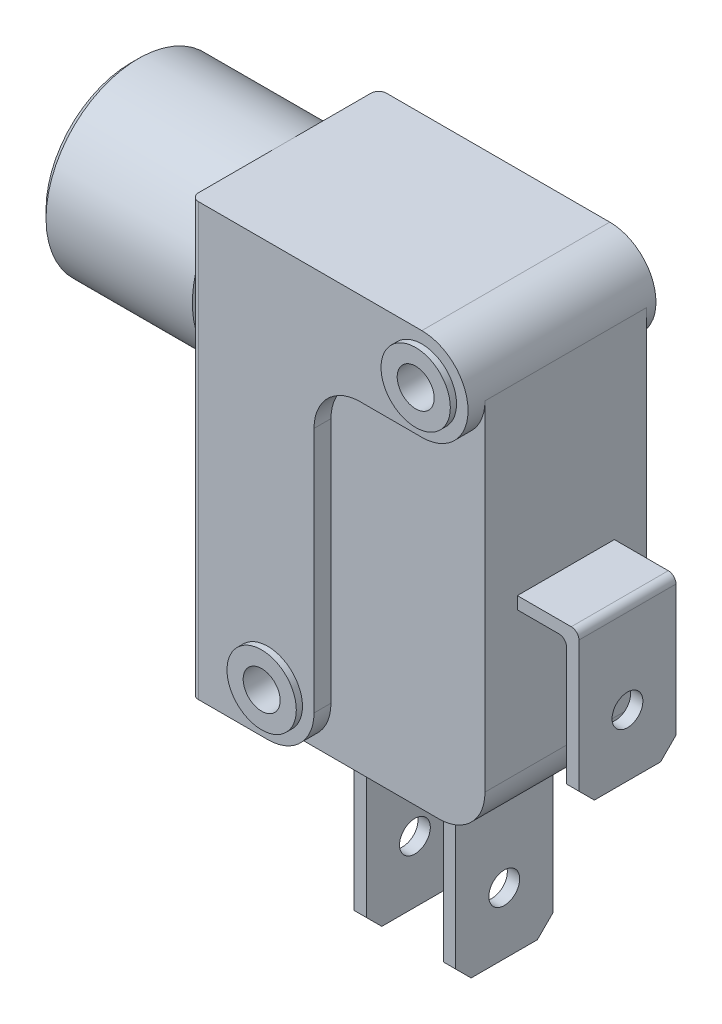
ISO-10303-21;
HEADER;
FILE_DESCRIPTION(('STEP AP214'),'2;1');
FILE_NAME('part.step','',(''),(''),'','','');
FILE_SCHEMA(('AUTOMOTIVE_DESIGN { 1 0 10303 214 1 1 1 1 }'));
ENDSEC;
DATA;
#1=APPLICATION_CONTEXT('core data for automotive mechanical design processes');
#2=APPLICATION_PROTOCOL_DEFINITION('international standard','automotive_design',2000,#1);
#3=PRODUCT_CONTEXT('',#1,'mechanical');
#4=PRODUCT('Part','Part','',(#3));
#5=PRODUCT_RELATED_PRODUCT_CATEGORY('part','',(#4));
#6=PRODUCT_DEFINITION_FORMATION('','',#4);
#7=PRODUCT_DEFINITION_CONTEXT('part definition',#1,'design');
#8=PRODUCT_DEFINITION('design','',#6,#7);
#9=PRODUCT_DEFINITION_SHAPE('','',#8);
#10=(LENGTH_UNIT() NAMED_UNIT(*) SI_UNIT(.MILLI.,.METRE.));
#11=(NAMED_UNIT(*) PLANE_ANGLE_UNIT() SI_UNIT($,.RADIAN.));
#12=(NAMED_UNIT(*) SI_UNIT($,.STERADIAN.) SOLID_ANGLE_UNIT());
#13=UNCERTAINTY_MEASURE_WITH_UNIT(LENGTH_MEASURE(1.E-05),#10,'distance_accuracy_value','');
#14=(GEOMETRIC_REPRESENTATION_CONTEXT(3) GLOBAL_UNCERTAINTY_ASSIGNED_CONTEXT((#13)) GLOBAL_UNIT_ASSIGNED_CONTEXT((#10,
#11,#12)) REPRESENTATION_CONTEXT('',''));
#15=CARTESIAN_POINT('',(0.,0.,0.));
#16=DIRECTION('',(0.,0.,1.));
#17=DIRECTION('',(1.,0.,0.));
#18=AXIS2_PLACEMENT_3D('',#15,#16,#17);
#19=CARTESIAN_POINT('',(0.,0.,13.));
#20=DIRECTION('',(0.,1.,0.));
#21=DIRECTION('',(0.,0.,1.));
#22=AXIS2_PLACEMENT_3D('',#19,#20,#21);
#23=PLANE('',#22);
#24=DIRECTION('',(1.,0.,0.));
#25=VECTOR('',#24,1.);
#26=CARTESIAN_POINT('',(0.,0.,3.1));
#27=LINE('',#26,#25);
#28=CARTESIAN_POINT('',(7.4,0.,3.1));
#29=VERTEX_POINT('',#28);
#30=CARTESIAN_POINT('',(8.2,0.,3.1));
#31=VERTEX_POINT('',#30);
#32=EDGE_CURVE('E416',#29,#31,#27,.T.);
#33=ORIENTED_EDGE('',*,*,#32,.F.);
#34=DIRECTION('',(0.,0.,1.));
#35=VECTOR('',#34,1.);
#36=CARTESIAN_POINT('',(7.4,0.,3.1));
#37=LINE('',#36,#35);
#38=CARTESIAN_POINT('',(7.4,0.,9.4));
#39=VERTEX_POINT('',#38);
#40=EDGE_CURVE('E398',#29,#39,#37,.T.);
#41=ORIENTED_EDGE('',*,*,#40,.T.);
#42=DIRECTION('',(1.,0.,0.));
#43=VECTOR('',#42,1.);
#44=CARTESIAN_POINT('',(0.,0.,9.4));
#45=LINE('',#44,#43);
#46=CARTESIAN_POINT('',(8.2,0.,9.4));
#47=VERTEX_POINT('',#46);
#48=EDGE_CURVE('E420',#39,#47,#45,.T.);
#49=ORIENTED_EDGE('',*,*,#48,.T.);
#50=DIRECTION('',(0.,0.,1.));
#51=VECTOR('',#50,1.);
#52=CARTESIAN_POINT('',(8.2,0.,3.1));
#53=LINE('',#52,#51);
#54=EDGE_CURVE('E370',#31,#47,#53,.T.);
#55=ORIENTED_EDGE('',*,*,#54,.F.);
#56=EDGE_LOOP('',(#33,#41,#49,#55));
#57=FACE_BOUND('',#56,.T.);
#58=DIRECTION('',(1.,0.,0.));
#59=VECTOR('',#58,1.);
#60=CARTESIAN_POINT('',(0.,0.,12.6));
#61=LINE('',#60,#59);
#62=CARTESIAN_POINT('',(0.5,0.,12.6));
#63=VERTEX_POINT('',#62);
#64=CARTESIAN_POINT('',(5.,0.,12.6));
#65=VERTEX_POINT('',#64);
#66=EDGE_CURVE('E533',#63,#65,#61,.T.);
#67=ORIENTED_EDGE('',*,*,#66,.F.);
#68=CARTESIAN_POINT('',(0.5,0.,12.1));
#69=DIRECTION('',(0.,1.,0.));
#70=DIRECTION('',(0.,0.,1.));
#71=AXIS2_PLACEMENT_3D('',#68,#69,#70);
#72=CIRCLE('',#71,0.5);
#73=CARTESIAN_POINT('',(0.,0.,12.1));
#74=VERTEX_POINT('',#73);
#75=EDGE_CURVE('E690',#63,#74,#72,.F.);
#76=ORIENTED_EDGE('',*,*,#75,.T.);
#77=DIRECTION('',(0.,0.,-1.));
#78=VECTOR('',#77,1.);
#79=CARTESIAN_POINT('',(0.,0.,13.));
#80=LINE('',#79,#78);
#81=CARTESIAN_POINT('',(0.,0.,0.900000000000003));
#82=VERTEX_POINT('',#81);
#83=EDGE_CURVE('E620',#74,#82,#80,.T.);
#84=ORIENTED_EDGE('',*,*,#83,.T.);
#85=CARTESIAN_POINT('',(0.5,0.,0.9));
#86=DIRECTION('',(0.,1.,0.));
#87=DIRECTION('',(0.,0.,1.));
#88=AXIS2_PLACEMENT_3D('',#85,#86,#87);
#89=CIRCLE('',#88,0.5);
#90=CARTESIAN_POINT('',(0.5,0.,0.4));
#91=VERTEX_POINT('',#90);
#92=EDGE_CURVE('E683',#82,#91,#89,.F.);
#93=ORIENTED_EDGE('',*,*,#92,.T.);
#94=DIRECTION('',(-1.,0.,0.));
#95=VECTOR('',#94,1.);
#96=CARTESIAN_POINT('',(0.,0.,0.4));
#97=LINE('',#96,#95);
#98=CARTESIAN_POINT('',(5.00000000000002,0.,0.4));
#99=VERTEX_POINT('',#98);
#100=EDGE_CURVE('E499',#99,#91,#97,.T.);
#101=ORIENTED_EDGE('',*,*,#100,.F.);
#102=DIRECTION('',(0.,0.,1.));
#103=VECTOR('',#102,1.);
#104=CARTESIAN_POINT('',(5.,0.,0.));
#105=LINE('',#104,#103);
#106=CARTESIAN_POINT('',(5.00000000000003,0.,0.999999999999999));
#107=VERTEX_POINT('',#106);
#108=EDGE_CURVE('E603',#99,#107,#105,.T.);
#109=ORIENTED_EDGE('',*,*,#108,.T.);
#110=DIRECTION('',(1.,0.,0.));
#111=VECTOR('',#110,1.);
#112=CARTESIAN_POINT('',(5.00000000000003,0.,0.999999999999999));
#113=LINE('',#112,#111);
#114=CARTESIAN_POINT('',(15.,0.,0.999999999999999));
#115=VERTEX_POINT('',#114);
#116=EDGE_CURVE('E555',#107,#115,#113,.T.);
#117=ORIENTED_EDGE('',*,*,#116,.T.);
#118=DIRECTION('',(0.,0.,1.));
#119=VECTOR('',#118,1.);
#120=CARTESIAN_POINT('',(15.,0.,11.5));
#121=LINE('',#120,#119);
#122=CARTESIAN_POINT('',(15.,0.,11.5));
#123=VERTEX_POINT('',#122);
#124=EDGE_CURVE('E658',#115,#123,#121,.T.);
#125=ORIENTED_EDGE('',*,*,#124,.T.);
#126=DIRECTION('',(1.,0.,0.));
#127=VECTOR('',#126,1.);
#128=CARTESIAN_POINT('',(5.00000000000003,0.,11.5));
#129=LINE('',#128,#127);
#130=CARTESIAN_POINT('',(5.00000000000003,0.,11.5));
#131=VERTEX_POINT('',#130);
#132=EDGE_CURVE('E554',#131,#123,#129,.T.);
#133=ORIENTED_EDGE('',*,*,#132,.F.);
#134=EDGE_CURVE('E606',#131,#65,#105,.T.);
#135=ORIENTED_EDGE('',*,*,#134,.T.);
#136=EDGE_LOOP('',(#67,#76,#84,#93,#101,#109,#117,#125,#133,#135));
#137=FACE_BOUND('',#136,.T.);
#138=DIRECTION('',(-1.,0.,0.));
#139=VECTOR('',#138,1.);
#140=CARTESIAN_POINT('',(14.,0.,3.1));
#141=LINE('',#140,#139);
#142=CARTESIAN_POINT('',(14.,0.,3.1));
#143=VERTEX_POINT('',#142);
#144=CARTESIAN_POINT('',(13.2,0.,3.1));
#145=VERTEX_POINT('',#144);
#146=EDGE_CURVE('E374',#143,#145,#141,.T.);
#147=ORIENTED_EDGE('',*,*,#146,.T.);
#148=DIRECTION('',(0.,0.,1.));
#149=VECTOR('',#148,1.);
#150=CARTESIAN_POINT('',(13.2,0.,3.1));
#151=LINE('',#150,#149);
#152=CARTESIAN_POINT('',(13.2,0.,9.4));
#153=VERTEX_POINT('',#152);
#154=EDGE_CURVE('E353',#145,#153,#151,.T.);
#155=ORIENTED_EDGE('',*,*,#154,.T.);
#156=DIRECTION('',(-1.,0.,0.));
#157=VECTOR('',#156,1.);
#158=CARTESIAN_POINT('',(14.,0.,9.4));
#159=LINE('',#158,#157);
#160=CARTESIAN_POINT('',(14.,0.,9.4));
#161=VERTEX_POINT('',#160);
#162=EDGE_CURVE('E360',#161,#153,#159,.T.);
#163=ORIENTED_EDGE('',*,*,#162,.F.);
#164=DIRECTION('',(0.,0.,1.));
#165=VECTOR('',#164,1.);
#166=CARTESIAN_POINT('',(14.,0.,3.1));
#167=LINE('',#166,#165);
#168=EDGE_CURVE('E391',#143,#161,#167,.T.);
#169=ORIENTED_EDGE('',*,*,#168,.F.);
#170=EDGE_LOOP('',(#147,#155,#163,#169));
#171=FACE_BOUND('',#170,.T.);
#172=ADVANCED_FACE('F42',(#57,#137,#171),#23,.F.);
#173=CARTESIAN_POINT('',(18.,0.,0.999999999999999));
#174=DIRECTION('',(1.,0.,0.));
#175=DIRECTION('',(0.,0.,-1.));
#176=AXIS2_PLACEMENT_3D('',#173,#174,#175);
#177=PLANE('',#176);
#178=DIRECTION('',(0.,1.,0.));
#179=VECTOR('',#178,1.);
#180=CARTESIAN_POINT('',(18.,0.,11.5));
#181=LINE('',#180,#179);
#182=CARTESIAN_POINT('',(18.,3.,11.5));
#183=VERTEX_POINT('',#182);
#184=CARTESIAN_POINT('',(18.,25.,11.5));
#185=VERTEX_POINT('',#184);
#186=EDGE_CURVE('E559',#183,#185,#181,.T.);
#187=ORIENTED_EDGE('',*,*,#186,.F.);
#188=DIRECTION('',(0.,0.,1.));
#189=VECTOR('',#188,1.);
#190=CARTESIAN_POINT('',(18.,3.,0.999999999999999));
#191=LINE('',#190,#189);
#192=CARTESIAN_POINT('',(18.,3.,0.999999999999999));
#193=VERTEX_POINT('',#192);
#194=EDGE_CURVE('E665',#183,#193,#191,.F.);
#195=ORIENTED_EDGE('',*,*,#194,.T.);
#196=DIRECTION('',(0.,1.,0.));
#197=VECTOR('',#196,1.);
#198=CARTESIAN_POINT('',(18.,0.,0.999999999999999));
#199=LINE('',#198,#197);
#200=CARTESIAN_POINT('',(18.,25.,0.999999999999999));
#201=VERTEX_POINT('',#200);
#202=EDGE_CURVE('E558',#193,#201,#199,.T.);
#203=ORIENTED_EDGE('',*,*,#202,.T.);
#204=DIRECTION('',(0.,0.,1.));
#205=VECTOR('',#204,1.);
#206=CARTESIAN_POINT('',(18.,25.,0.999999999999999));
#207=LINE('',#206,#205);
#208=EDGE_CURVE('E561',#201,#185,#207,.T.);
#209=ORIENTED_EDGE('',*,*,#208,.T.);
#210=EDGE_LOOP('',(#187,#195,#203,#209));
#211=FACE_BOUND('',#210,.T.);
#212=DIRECTION('',(0.,0.,1.));
#213=VECTOR('',#212,1.);
#214=CARTESIAN_POINT('',(18.,13.,3.1));
#215=LINE('',#214,#213);
#216=CARTESIAN_POINT('',(18.,13.,3.1));
#217=VERTEX_POINT('',#216);
#218=CARTESIAN_POINT('',(18.,13.,9.4));
#219=VERTEX_POINT('',#218);
#220=EDGE_CURVE('E461',#217,#219,#215,.T.);
#221=ORIENTED_EDGE('',*,*,#220,.F.);
#222=DIRECTION('',(0.,1.,0.));
#223=VECTOR('',#222,1.);
#224=CARTESIAN_POINT('',(18.,0.,3.1));
#225=LINE('',#224,#223);
#226=CARTESIAN_POINT('',(18.,12.2,3.1));
#227=VERTEX_POINT('',#226);
#228=EDGE_CURVE('E443',#227,#217,#225,.T.);
#229=ORIENTED_EDGE('',*,*,#228,.F.);
#230=DIRECTION('',(0.,0.,1.));
#231=VECTOR('',#230,1.);
#232=CARTESIAN_POINT('',(18.,12.2,3.1));
#233=LINE('',#232,#231);
#234=CARTESIAN_POINT('',(18.,12.2,9.4));
#235=VERTEX_POINT('',#234);
#236=EDGE_CURVE('E458',#227,#235,#233,.T.);
#237=ORIENTED_EDGE('',*,*,#236,.T.);
#238=DIRECTION('',(0.,1.,0.));
#239=VECTOR('',#238,1.);
#240=CARTESIAN_POINT('',(18.,0.,9.4));
#241=LINE('',#240,#239);
#242=EDGE_CURVE('E436',#235,#219,#241,.T.);
#243=ORIENTED_EDGE('',*,*,#242,.T.);
#244=EDGE_LOOP('',(#221,#229,#237,#243));
#245=FACE_BOUND('',#244,.T.);
#246=ADVANCED_FACE('F800',(#211,#245),#177,.T.);
#247=CARTESIAN_POINT('',(0.,0.,13.));
#248=DIRECTION('',(1.,0.,0.));
#249=DIRECTION('',(0.,0.,-1.));
#250=AXIS2_PLACEMENT_3D('',#247,#248,#249);
#251=PLANE('',#250);
#252=CARTESIAN_POINT('',(0.,22.,6.5));
#253=DIRECTION('',(-1.,0.,0.));
#254=DIRECTION('',(0.,0.,1.));
#255=AXIS2_PLACEMENT_3D('',#252,#253,#254);
#256=CIRCLE('',#255,6.);
#257=CARTESIAN_POINT('',(0.,19.8459340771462,0.9));
#258=VERTEX_POINT('',#257);
#259=CARTESIAN_POINT('',(0.,19.8459340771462,12.1));
#260=VERTEX_POINT('',#259);
#261=EDGE_CURVE('E1123',#258,#260,#256,.T.);
#262=ORIENTED_EDGE('',*,*,#261,.F.);
#263=DIRECTION('',(0.,1.,0.));
#264=VECTOR('',#263,1.);
#265=CARTESIAN_POINT('',(0.,0.,0.9));
#266=LINE('',#265,#264);
#267=EDGE_CURVE('E678',#258,#82,#266,.F.);
#268=ORIENTED_EDGE('',*,*,#267,.T.);
#269=ORIENTED_EDGE('',*,*,#83,.F.);
#270=DIRECTION('',(0.,-1.,0.));
#271=VECTOR('',#270,1.);
#272=CARTESIAN_POINT('',(0.,0.,12.1));
#273=LINE('',#272,#271);
#274=EDGE_CURVE('E694',#74,#260,#273,.F.);
#275=ORIENTED_EDGE('',*,*,#274,.T.);
#276=EDGE_LOOP('',(#262,#268,#269,#275));
#277=FACE_BOUND('',#276,.T.);
#278=ADVANCED_FACE('F840',(#277),#251,.F.);
#279=CARTESIAN_POINT('',(0.,24.1540659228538,12.1));
#280=VERTEX_POINT('',#279);
#281=CARTESIAN_POINT('',(0.,28.,6.5));
#282=VERTEX_POINT('',#281);
#283=EDGE_CURVE('E479',#280,#282,#256,.T.);
#284=ORIENTED_EDGE('',*,*,#283,.F.);
#285=CARTESIAN_POINT('',(0.,28.,12.1));
#286=VERTEX_POINT('',#285);
#287=EDGE_CURVE('E693',#280,#286,#273,.F.);
#288=ORIENTED_EDGE('',*,*,#287,.T.);
#289=DIRECTION('',(0.,0.,-1.));
#290=VECTOR('',#289,1.);
#291=CARTESIAN_POINT('',(0.,28.,13.));
#292=LINE('',#291,#290);
#293=EDGE_CURVE('E616',#286,#282,#292,.T.);
#294=ORIENTED_EDGE('',*,*,#293,.T.);
#295=EDGE_LOOP('',(#284,#288,#294));
#296=FACE_BOUND('',#295,.T.);
#297=ADVANCED_FACE('F855',(#296),#251,.F.);
#298=CARTESIAN_POINT('',(15.,25.,0.));
#299=DIRECTION('',(0.,0.,1.));
#300=DIRECTION('',(1.,0.,0.));
#301=AXIS2_PLACEMENT_3D('',#298,#299,#300);
#302=CYLINDRICAL_SURFACE('',#301,3.);
#303=DIRECTION('',(0.,0.,1.));
#304=VECTOR('',#303,1.);
#305=CARTESIAN_POINT('',(15.,22.,0.));
#306=LINE('',#305,#304);
#307=CARTESIAN_POINT('',(15.,22.,0.4));
#308=VERTEX_POINT('',#307);
#309=CARTESIAN_POINT('',(15.,22.,0.999999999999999));
#310=VERTEX_POINT('',#309);
#311=EDGE_CURVE('E611',#308,#310,#306,.T.);
#312=ORIENTED_EDGE('',*,*,#311,.F.);
#313=CARTESIAN_POINT('',(15.,25.,0.4));
#314=DIRECTION('',(0.,0.,-1.));
#315=DIRECTION('',(-1.,0.,0.));
#316=AXIS2_PLACEMENT_3D('',#313,#314,#315);
#317=CIRCLE('',#316,3.);
#318=CARTESIAN_POINT('',(15.,28.,0.4));
#319=VERTEX_POINT('',#318);
#320=EDGE_CURVE('E515',#308,#319,#317,.F.);
#321=ORIENTED_EDGE('',*,*,#320,.T.);
#322=DIRECTION('',(0.,0.,1.));
#323=VECTOR('',#322,1.);
#324=CARTESIAN_POINT('',(15.,28.,0.));
#325=LINE('',#324,#323);
#326=CARTESIAN_POINT('',(15.,28.,12.6));
#327=VERTEX_POINT('',#326);
#328=EDGE_CURVE('E600',#319,#327,#325,.T.);
#329=ORIENTED_EDGE('',*,*,#328,.T.);
#330=CARTESIAN_POINT('',(15.,25.,12.6));
#331=DIRECTION('',(0.,0.,-1.));
#332=DIRECTION('',(-1.,0.,0.));
#333=AXIS2_PLACEMENT_3D('',#330,#331,#332);
#334=CIRCLE('',#333,3.);
#335=CARTESIAN_POINT('',(15.,22.,12.6));
#336=VERTEX_POINT('',#335);
#337=EDGE_CURVE('E548',#336,#327,#334,.F.);
#338=ORIENTED_EDGE('',*,*,#337,.F.);
#339=CARTESIAN_POINT('',(15.,22.,11.5));
#340=VERTEX_POINT('',#339);
#341=EDGE_CURVE('E613',#340,#336,#306,.T.);
#342=ORIENTED_EDGE('',*,*,#341,.F.);
#343=CARTESIAN_POINT('',(15.,25.,11.5));
#344=DIRECTION('',(0.,0.,1.));
#345=DIRECTION('',(1.,0.,0.));
#346=AXIS2_PLACEMENT_3D('',#343,#344,#345);
#347=CIRCLE('',#346,3.);
#348=EDGE_CURVE('E575',#185,#340,#347,.F.);
#349=ORIENTED_EDGE('',*,*,#348,.F.);
#350=ORIENTED_EDGE('',*,*,#208,.F.);
#351=CARTESIAN_POINT('',(15.,25.,0.999999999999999));
#352=DIRECTION('',(0.,0.,1.));
#353=DIRECTION('',(1.,0.,0.));
#354=AXIS2_PLACEMENT_3D('',#351,#352,#353);
#355=CIRCLE('',#354,3.);
#356=EDGE_CURVE('E585',#201,#310,#355,.F.);
#357=ORIENTED_EDGE('',*,*,#356,.T.);
#358=EDGE_LOOP('',(#312,#321,#329,#338,#342,#349,#350,#357));
#359=FACE_BOUND('',#358,.T.);
#360=ADVANCED_FACE('F1045',(#359),#302,.T.);
#361=CARTESIAN_POINT('',(5.,3.,0.));
#362=DIRECTION('',(0.,0.,1.));
#363=DIRECTION('',(1.,0.,0.));
#364=AXIS2_PLACEMENT_3D('',#361,#362,#363);
#365=CYLINDRICAL_SURFACE('',#364,3.);
#366=ORIENTED_EDGE('',*,*,#108,.F.);
#367=CARTESIAN_POINT('',(5.,3.,0.4));
#368=DIRECTION('',(0.,0.,-1.));
#369=DIRECTION('',(-1.,0.,0.));
#370=AXIS2_PLACEMENT_3D('',#367,#368,#369);
#371=CIRCLE('',#370,3.);
#372=CARTESIAN_POINT('',(8.,3.00000000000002,0.4));
#373=VERTEX_POINT('',#372);
#374=EDGE_CURVE('E512',#99,#373,#371,.F.);
#375=ORIENTED_EDGE('',*,*,#374,.T.);
#376=DIRECTION('',(0.,0.,1.));
#377=VECTOR('',#376,1.);
#378=CARTESIAN_POINT('',(8.,3.00000000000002,0.));
#379=LINE('',#378,#377);
#380=CARTESIAN_POINT('',(8.,3.00000000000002,0.999999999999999));
#381=VERTEX_POINT('',#380);
#382=EDGE_CURVE('E607',#373,#381,#379,.T.);
#383=ORIENTED_EDGE('',*,*,#382,.T.);
#384=CARTESIAN_POINT('',(5.,3.,0.999999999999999));
#385=DIRECTION('',(0.,0.,1.));
#386=DIRECTION('',(1.,0.,0.));
#387=AXIS2_PLACEMENT_3D('',#384,#385,#386);
#388=CIRCLE('',#387,3.);
#389=EDGE_CURVE('E582',#381,#107,#388,.F.);
#390=ORIENTED_EDGE('',*,*,#389,.T.);
#391=EDGE_LOOP('',(#366,#375,#383,#390));
#392=FACE_BOUND('',#391,.T.);
#393=ADVANCED_FACE('F1036',(#392),#365,.T.);
#394=CARTESIAN_POINT('',(8.,0.,0.));
#395=DIRECTION('',(1.,0.,0.));
#396=DIRECTION('',(0.,0.,-1.));
#397=AXIS2_PLACEMENT_3D('',#394,#395,#396);
#398=PLANE('',#397);
#399=ORIENTED_EDGE('',*,*,#382,.F.);
#400=DIRECTION('',(0.,1.,0.));
#401=VECTOR('',#400,1.);
#402=CARTESIAN_POINT('',(8.,0.,0.4));
#403=LINE('',#402,#401);
#404=CARTESIAN_POINT('',(8.,19.,0.4));
#405=VERTEX_POINT('',#404);
#406=EDGE_CURVE('E508',#373,#405,#403,.T.);
#407=ORIENTED_EDGE('',*,*,#406,.T.);
#408=DIRECTION('',(0.,0.,1.));
#409=VECTOR('',#408,1.);
#410=CARTESIAN_POINT('',(8.,19.,0.));
#411=LINE('',#410,#409);
#412=CARTESIAN_POINT('',(8.,19.,0.999999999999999));
#413=VERTEX_POINT('',#412);
#414=EDGE_CURVE('E641',#405,#413,#411,.T.);
#415=ORIENTED_EDGE('',*,*,#414,.T.);
#416=DIRECTION('',(0.,-1.,0.));
#417=VECTOR('',#416,1.);
#418=CARTESIAN_POINT('',(8.,0.,0.999999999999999));
#419=LINE('',#418,#417);
#420=EDGE_CURVE('E578',#413,#381,#419,.T.);
#421=ORIENTED_EDGE('',*,*,#420,.T.);
#422=EDGE_LOOP('',(#399,#407,#415,#421));
#423=FACE_BOUND('',#422,.T.);
#424=ADVANCED_FACE('F1040',(#423),#398,.T.);
#425=CARTESIAN_POINT('',(0.,22.,0.));
#426=DIRECTION('',(0.,1.,0.));
#427=DIRECTION('',(-1.,0.,0.));
#428=AXIS2_PLACEMENT_3D('',#425,#426,#427);
#429=PLANE('',#428);
#430=DIRECTION('',(-1.,0.,0.));
#431=VECTOR('',#430,1.);
#432=CARTESIAN_POINT('',(0.,22.,0.4));
#433=LINE('',#432,#431);
#434=CARTESIAN_POINT('',(11.,22.,0.4));
#435=VERTEX_POINT('',#434);
#436=EDGE_CURVE('E505',#308,#435,#433,.T.);
#437=ORIENTED_EDGE('',*,*,#436,.F.);
#438=ORIENTED_EDGE('',*,*,#311,.T.);
#439=DIRECTION('',(1.,0.,0.));
#440=VECTOR('',#439,1.);
#441=CARTESIAN_POINT('',(0.,22.,0.999999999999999));
#442=LINE('',#441,#440);
#443=CARTESIAN_POINT('',(11.,22.,0.999999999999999));
#444=VERTEX_POINT('',#443);
#445=EDGE_CURVE('E627',#444,#310,#442,.T.);
#446=ORIENTED_EDGE('',*,*,#445,.F.);
#447=DIRECTION('',(0.,0.,1.));
#448=VECTOR('',#447,1.);
#449=CARTESIAN_POINT('',(11.,22.,0.));
#450=LINE('',#449,#448);
#451=EDGE_CURVE('E647',#444,#435,#450,.F.);
#452=ORIENTED_EDGE('',*,*,#451,.T.);
#453=EDGE_LOOP('',(#437,#438,#446,#452));
#454=FACE_BOUND('',#453,.T.);
#455=ADVANCED_FACE('F1044',(#454),#429,.F.);
#456=CARTESIAN_POINT('',(0.,28.,13.));
#457=DIRECTION('',(0.,-1.,0.));
#458=DIRECTION('',(0.,0.,-1.));
#459=AXIS2_PLACEMENT_3D('',#456,#457,#458);
#460=PLANE('',#459);
#461=ORIENTED_EDGE('',*,*,#293,.F.);
#462=CARTESIAN_POINT('',(0.5,28.,12.1));
#463=DIRECTION('',(0.,-1.,0.));
#464=DIRECTION('',(0.,0.,-1.));
#465=AXIS2_PLACEMENT_3D('',#462,#463,#464);
#466=CIRCLE('',#465,0.5);
#467=CARTESIAN_POINT('',(0.5,28.,12.6));
#468=VERTEX_POINT('',#467);
#469=EDGE_CURVE('E698',#286,#468,#466,.F.);
#470=ORIENTED_EDGE('',*,*,#469,.T.);
#471=DIRECTION('',(1.,0.,0.));
#472=VECTOR('',#471,1.);
#473=CARTESIAN_POINT('',(0.,28.,12.6));
#474=LINE('',#473,#472);
#475=EDGE_CURVE('E551',#468,#327,#474,.T.);
#476=ORIENTED_EDGE('',*,*,#475,.T.);
#477=ORIENTED_EDGE('',*,*,#328,.F.);
#478=DIRECTION('',(1.,0.,0.));
#479=VECTOR('',#478,1.);
#480=CARTESIAN_POINT('',(0.,28.,0.399999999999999));
#481=LINE('',#480,#479);
#482=CARTESIAN_POINT('',(0.5,28.,0.399999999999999));
#483=VERTEX_POINT('',#482);
#484=EDGE_CURVE('E518',#483,#319,#481,.T.);
#485=ORIENTED_EDGE('',*,*,#484,.F.);
#486=CARTESIAN_POINT('',(0.5,28.,0.9));
#487=DIRECTION('',(0.,-1.,0.));
#488=DIRECTION('',(0.,0.,-1.));
#489=AXIS2_PLACEMENT_3D('',#486,#487,#488);
#490=CIRCLE('',#489,0.5);
#491=CARTESIAN_POINT('',(0.,28.,0.900000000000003));
#492=VERTEX_POINT('',#491);
#493=EDGE_CURVE('E674',#483,#492,#490,.F.);
#494=ORIENTED_EDGE('',*,*,#493,.T.);
#495=EDGE_CURVE('E605',#282,#492,#292,.T.);
#496=ORIENTED_EDGE('',*,*,#495,.F.);
#497=EDGE_LOOP('',(#461,#470,#476,#477,#485,#494,#496));
#498=FACE_BOUND('',#497,.T.);
#499=ADVANCED_FACE('F847',(#498),#460,.F.);
#500=CARTESIAN_POINT('',(14.,4.,0.));
#501=DIRECTION('',(0.,0.,1.));
#502=DIRECTION('',(1.,0.,0.));
#503=AXIS2_PLACEMENT_3D('',#500,#501,#502);
#504=PLANE('',#503);
#505=CARTESIAN_POINT('',(15.,25.,0.));
#506=DIRECTION('',(0.,0.,1.));
#507=DIRECTION('',(1.,0.,0.));
#508=AXIS2_PLACEMENT_3D('',#505,#506,#507);
#509=CIRCLE('',#508,1.2);
#510=CARTESIAN_POINT('',(16.2,25.,0.));
#511=VERTEX_POINT('',#510);
#512=EDGE_CURVE('E597',#511,#511,#509,.T.);
#513=ORIENTED_EDGE('',*,*,#512,.T.);
#514=EDGE_LOOP('',(#513));
#515=FACE_BOUND('',#514,.T.);
#516=CARTESIAN_POINT('',(15.,25.,0.));
#517=DIRECTION('',(0.,0.,-1.));
#518=DIRECTION('',(-1.,0.,0.));
#519=AXIS2_PLACEMENT_3D('',#516,#517,#518);
#520=CIRCLE('',#519,2.25);
#521=CARTESIAN_POINT('',(12.75,25.,0.));
#522=VERTEX_POINT('',#521);
#523=EDGE_CURVE('E492',#522,#522,#520,.T.);
#524=ORIENTED_EDGE('',*,*,#523,.T.);
#525=EDGE_LOOP('',(#524));
#526=FACE_BOUND('',#525,.T.);
#527=ADVANCED_FACE('F1051',(#515,#526),#504,.F.);
#528=CARTESIAN_POINT('',(5.,3.,0.));
#529=DIRECTION('',(0.,0.,1.));
#530=DIRECTION('',(1.,0.,0.));
#531=AXIS2_PLACEMENT_3D('',#528,#529,#530);
#532=CIRCLE('',#531,1.2);
#533=CARTESIAN_POINT('',(6.2,3.,0.));
#534=VERTEX_POINT('',#533);
#535=EDGE_CURVE('E589',#534,#534,#532,.T.);
#536=ORIENTED_EDGE('',*,*,#535,.T.);
#537=EDGE_LOOP('',(#536));
#538=FACE_BOUND('',#537,.T.);
#539=CARTESIAN_POINT('',(5.,3.,0.));
#540=DIRECTION('',(0.,0.,-1.));
#541=DIRECTION('',(-1.,0.,0.));
#542=AXIS2_PLACEMENT_3D('',#539,#540,#541);
#543=CIRCLE('',#542,2.25);
#544=CARTESIAN_POINT('',(2.75,3.,0.));
#545=VERTEX_POINT('',#544);
#546=EDGE_CURVE('E487',#545,#545,#543,.T.);
#547=ORIENTED_EDGE('',*,*,#546,.T.);
#548=EDGE_LOOP('',(#547));
#549=FACE_BOUND('',#548,.T.);
#550=ADVANCED_FACE('F853',(#538,#549),#504,.F.);
#551=CARTESIAN_POINT('',(0.,24.1540659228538,0.9));
#552=VERTEX_POINT('',#551);
#553=EDGE_CURVE('E484',#282,#552,#256,.T.);
#554=ORIENTED_EDGE('',*,*,#553,.F.);
#555=ORIENTED_EDGE('',*,*,#495,.T.);
#556=EDGE_CURVE('E679',#492,#552,#266,.F.);
#557=ORIENTED_EDGE('',*,*,#556,.T.);
#558=EDGE_LOOP('',(#554,#555,#557));
#559=FACE_BOUND('',#558,.T.);
#560=ADVANCED_FACE('F849',(#559),#251,.F.);
#561=CARTESIAN_POINT('',(11.,19.,0.));
#562=DIRECTION('',(0.,0.,1.));
#563=DIRECTION('',(1.,0.,0.));
#564=AXIS2_PLACEMENT_3D('',#561,#562,#563);
#565=CYLINDRICAL_SURFACE('',#564,3.);
#566=CARTESIAN_POINT('',(11.,19.,0.4));
#567=DIRECTION('',(0.,0.,-1.));
#568=DIRECTION('',(-1.,0.,0.));
#569=AXIS2_PLACEMENT_3D('',#566,#567,#568);
#570=CIRCLE('',#569,3.);
#571=EDGE_CURVE('E655',#435,#405,#570,.F.);
#572=ORIENTED_EDGE('',*,*,#571,.F.);
#573=ORIENTED_EDGE('',*,*,#451,.F.);
#574=CARTESIAN_POINT('',(11.,19.,0.999999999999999));
#575=DIRECTION('',(0.,0.,1.));
#576=DIRECTION('',(1.,0.,0.));
#577=AXIS2_PLACEMENT_3D('',#574,#575,#576);
#578=CIRCLE('',#577,3.);
#579=EDGE_CURVE('E644',#413,#444,#578,.F.);
#580=ORIENTED_EDGE('',*,*,#579,.F.);
#581=ORIENTED_EDGE('',*,*,#414,.F.);
#582=EDGE_LOOP('',(#572,#573,#580,#581));
#583=FACE_BOUND('',#582,.T.);
#584=ADVANCED_FACE('F852',(#583),#565,.F.);
#585=CARTESIAN_POINT('',(14.,4.,13.));
#586=DIRECTION('',(0.,0.,1.));
#587=DIRECTION('',(1.,0.,0.));
#588=AXIS2_PLACEMENT_3D('',#585,#586,#587);
#589=PLANE('',#588);
#590=CARTESIAN_POINT('',(15.,25.,13.));
#591=DIRECTION('',(0.,0.,1.));
#592=DIRECTION('',(1.,0.,0.));
#593=AXIS2_PLACEMENT_3D('',#590,#591,#592);
#594=CIRCLE('',#593,1.2);
#595=CARTESIAN_POINT('',(16.2,25.,13.));
#596=VERTEX_POINT('',#595);
#597=EDGE_CURVE('E593',#596,#596,#594,.T.);
#598=ORIENTED_EDGE('',*,*,#597,.F.);
#599=EDGE_LOOP('',(#598));
#600=FACE_BOUND('',#599,.T.);
#601=CARTESIAN_POINT('',(15.,25.,13.));
#602=DIRECTION('',(0.,0.,1.));
#603=DIRECTION('',(1.,0.,0.));
#604=AXIS2_PLACEMENT_3D('',#601,#602,#603);
#605=CIRCLE('',#604,2.25);
#606=CARTESIAN_POINT('',(17.25,25.,13.));
#607=VERTEX_POINT('',#606);
#608=EDGE_CURVE('E526',#607,#607,#605,.T.);
#609=ORIENTED_EDGE('',*,*,#608,.T.);
#610=EDGE_LOOP('',(#609));
#611=FACE_BOUND('',#610,.T.);
#612=ADVANCED_FACE('F864',(#600,#611),#589,.T.);
#613=CARTESIAN_POINT('',(5.,3.,13.));
#614=DIRECTION('',(0.,0.,1.));
#615=DIRECTION('',(1.,0.,0.));
#616=AXIS2_PLACEMENT_3D('',#613,#614,#615);
#617=CIRCLE('',#616,1.2);
#618=CARTESIAN_POINT('',(6.2,3.,13.));
#619=VERTEX_POINT('',#618);
#620=EDGE_CURVE('E588',#619,#619,#617,.T.);
#621=ORIENTED_EDGE('',*,*,#620,.F.);
#622=EDGE_LOOP('',(#621));
#623=FACE_BOUND('',#622,.T.);
#624=CARTESIAN_POINT('',(5.,3.,13.));
#625=DIRECTION('',(0.,0.,1.));
#626=DIRECTION('',(1.,0.,0.));
#627=AXIS2_PLACEMENT_3D('',#624,#625,#626);
#628=CIRCLE('',#627,2.25);
#629=CARTESIAN_POINT('',(7.25,3.,13.));
#630=VERTEX_POINT('',#629);
#631=EDGE_CURVE('E521',#630,#630,#628,.T.);
#632=ORIENTED_EDGE('',*,*,#631,.T.);
#633=EDGE_LOOP('',(#632));
#634=FACE_BOUND('',#633,.T.);
#635=ADVANCED_FACE('F1034',(#623,#634),#589,.T.);
#636=CARTESIAN_POINT('',(5.,3.,12.6));
#637=DIRECTION('',(0.,0.,-1.));
#638=DIRECTION('',(-1.,0.,0.));
#639=AXIS2_PLACEMENT_3D('',#636,#637,#638);
#640=CIRCLE('',#639,3.);
#641=CARTESIAN_POINT('',(8.,3.00000000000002,12.6));
#642=VERTEX_POINT('',#641);
#643=EDGE_CURVE('E545',#65,#642,#640,.F.);
#644=ORIENTED_EDGE('',*,*,#643,.F.);
#645=ORIENTED_EDGE('',*,*,#134,.F.);
#646=CARTESIAN_POINT('',(5.,3.,11.5));
#647=DIRECTION('',(0.,0.,1.));
#648=DIRECTION('',(1.,0.,0.));
#649=AXIS2_PLACEMENT_3D('',#646,#647,#648);
#650=CIRCLE('',#649,3.);
#651=CARTESIAN_POINT('',(8.,3.00000000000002,11.5));
#652=VERTEX_POINT('',#651);
#653=EDGE_CURVE('E572',#652,#131,#650,.F.);
#654=ORIENTED_EDGE('',*,*,#653,.F.);
#655=EDGE_CURVE('E610',#652,#642,#379,.T.);
#656=ORIENTED_EDGE('',*,*,#655,.T.);
#657=EDGE_LOOP('',(#644,#645,#654,#656));
#658=FACE_BOUND('',#657,.T.);
#659=ADVANCED_FACE('F1030',(#658),#365,.T.);
#660=DIRECTION('',(0.,1.,0.));
#661=VECTOR('',#660,1.);
#662=CARTESIAN_POINT('',(8.,0.,12.6));
#663=LINE('',#662,#661);
#664=CARTESIAN_POINT('',(8.,19.,12.6));
#665=VERTEX_POINT('',#664);
#666=EDGE_CURVE('E542',#642,#665,#663,.T.);
#667=ORIENTED_EDGE('',*,*,#666,.F.);
#668=ORIENTED_EDGE('',*,*,#655,.F.);
#669=DIRECTION('',(0.,-1.,0.));
#670=VECTOR('',#669,1.);
#671=CARTESIAN_POINT('',(8.,0.,11.5));
#672=LINE('',#671,#670);
#673=CARTESIAN_POINT('',(8.,19.,11.5));
#674=VERTEX_POINT('',#673);
#675=EDGE_CURVE('E569',#674,#652,#672,.T.);
#676=ORIENTED_EDGE('',*,*,#675,.F.);
#677=DIRECTION('',(0.,0.,1.));
#678=VECTOR('',#677,1.);
#679=CARTESIAN_POINT('',(8.,19.,0.));
#680=LINE('',#679,#678);
#681=EDGE_CURVE('E631',#674,#665,#680,.T.);
#682=ORIENTED_EDGE('',*,*,#681,.T.);
#683=EDGE_LOOP('',(#667,#668,#676,#682));
#684=FACE_BOUND('',#683,.T.);
#685=ADVANCED_FACE('F1033',(#684),#398,.T.);
#686=ORIENTED_EDGE('',*,*,#341,.T.);
#687=DIRECTION('',(-1.,0.,0.));
#688=VECTOR('',#687,1.);
#689=CARTESIAN_POINT('',(0.,22.,12.6));
#690=LINE('',#689,#688);
#691=CARTESIAN_POINT('',(11.,22.,12.6));
#692=VERTEX_POINT('',#691);
#693=EDGE_CURVE('E538',#336,#692,#690,.T.);
#694=ORIENTED_EDGE('',*,*,#693,.T.);
#695=DIRECTION('',(0.,0.,1.));
#696=VECTOR('',#695,1.);
#697=CARTESIAN_POINT('',(11.,22.,0.));
#698=LINE('',#697,#696);
#699=CARTESIAN_POINT('',(11.,22.,11.5));
#700=VERTEX_POINT('',#699);
#701=EDGE_CURVE('E635',#692,#700,#698,.F.);
#702=ORIENTED_EDGE('',*,*,#701,.T.);
#703=DIRECTION('',(1.,0.,0.));
#704=VECTOR('',#703,1.);
#705=CARTESIAN_POINT('',(0.,22.,11.5));
#706=LINE('',#705,#704);
#707=EDGE_CURVE('E624',#700,#340,#706,.T.);
#708=ORIENTED_EDGE('',*,*,#707,.T.);
#709=EDGE_LOOP('',(#686,#694,#702,#708));
#710=FACE_BOUND('',#709,.T.);
#711=ADVANCED_FACE('F1028',(#710),#429,.F.);
#712=CARTESIAN_POINT('',(15.,25.,0.));
#713=DIRECTION('',(0.,0.,1.));
#714=DIRECTION('',(1.,0.,0.));
#715=AXIS2_PLACEMENT_3D('',#712,#713,#714);
#716=CYLINDRICAL_SURFACE('',#715,1.2);
#717=CARTESIAN_POINT('',(16.2,25.,0.));
#718=CARTESIAN_POINT('',(16.2,25.,0.135416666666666));
#719=CARTESIAN_POINT('',(16.2,25.,0.270833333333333));
#720=CARTESIAN_POINT('',(16.2,25.,0.541666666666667));
#721=CARTESIAN_POINT('',(16.2,25.,0.677083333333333));
#722=CARTESIAN_POINT('',(16.2,25.,0.947916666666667));
#723=CARTESIAN_POINT('',(16.2,25.,1.08333333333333));
#724=CARTESIAN_POINT('',(16.2,25.,1.35416666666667));
#725=CARTESIAN_POINT('',(16.2,25.,1.48958333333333));
#726=CARTESIAN_POINT('',(16.2,25.,1.76041666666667));
#727=CARTESIAN_POINT('',(16.2,25.,1.89583333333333));
#728=CARTESIAN_POINT('',(16.2,25.,2.16666666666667));
#729=CARTESIAN_POINT('',(16.2,25.,2.30208333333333));
#730=CARTESIAN_POINT('',(16.2,25.,2.57291666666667));
#731=CARTESIAN_POINT('',(16.2,25.,2.70833333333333));
#732=CARTESIAN_POINT('',(16.2,25.,2.97916666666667));
#733=CARTESIAN_POINT('',(16.2,25.,3.11458333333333));
#734=CARTESIAN_POINT('',(16.2,25.,3.38541666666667));
#735=CARTESIAN_POINT('',(16.2,25.,3.52083333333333));
#736=CARTESIAN_POINT('',(16.2,25.,3.79166666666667));
#737=CARTESIAN_POINT('',(16.2,25.,3.92708333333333));
#738=CARTESIAN_POINT('',(16.2,25.,4.19791666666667));
#739=CARTESIAN_POINT('',(16.2,25.,4.33333333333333));
#740=CARTESIAN_POINT('',(16.2,25.,4.60416666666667));
#741=CARTESIAN_POINT('',(16.2,25.,4.73958333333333));
#742=CARTESIAN_POINT('',(16.2,25.,5.01041666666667));
#743=CARTESIAN_POINT('',(16.2,25.,5.14583333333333));
#744=CARTESIAN_POINT('',(16.2,25.,5.41666666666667));
#745=CARTESIAN_POINT('',(16.2,25.,5.55208333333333));
#746=CARTESIAN_POINT('',(16.2,25.,5.82291666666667));
#747=CARTESIAN_POINT('',(16.2,25.,5.95833333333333));
#748=CARTESIAN_POINT('',(16.2,25.,6.22916666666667));
#749=CARTESIAN_POINT('',(16.2,25.,6.36458333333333));
#750=CARTESIAN_POINT('',(16.2,25.,6.63541666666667));
#751=CARTESIAN_POINT('',(16.2,25.,6.77083333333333));
#752=CARTESIAN_POINT('',(16.2,25.,7.04166666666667));
#753=CARTESIAN_POINT('',(16.2,25.,7.17708333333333));
#754=CARTESIAN_POINT('',(16.2,25.,7.44791666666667));
#755=CARTESIAN_POINT('',(16.2,25.,7.58333333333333));
#756=CARTESIAN_POINT('',(16.2,25.,7.85416666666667));
#757=CARTESIAN_POINT('',(16.2,25.,7.98958333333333));
#758=CARTESIAN_POINT('',(16.2,25.,8.26041666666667));
#759=CARTESIAN_POINT('',(16.2,25.,8.39583333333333));
#760=CARTESIAN_POINT('',(16.2,25.,8.66666666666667));
#761=CARTESIAN_POINT('',(16.2,25.,8.80208333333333));
#762=CARTESIAN_POINT('',(16.2,25.,9.07291666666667));
#763=CARTESIAN_POINT('',(16.2,25.,9.20833333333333));
#764=CARTESIAN_POINT('',(16.2,25.,9.47916666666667));
#765=CARTESIAN_POINT('',(16.2,25.,9.61458333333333));
#766=CARTESIAN_POINT('',(16.2,25.,9.88541666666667));
#767=CARTESIAN_POINT('',(16.2,25.,10.0208333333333));
#768=CARTESIAN_POINT('',(16.2,25.,10.2916666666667));
#769=CARTESIAN_POINT('',(16.2,25.,10.4270833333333));
#770=CARTESIAN_POINT('',(16.2,25.,10.6979166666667));
#771=CARTESIAN_POINT('',(16.2,25.,10.8333333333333));
#772=CARTESIAN_POINT('',(16.2,25.,11.1041666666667));
#773=CARTESIAN_POINT('',(16.2,25.,11.2395833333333));
#774=CARTESIAN_POINT('',(16.2,25.,11.5104166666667));
#775=CARTESIAN_POINT('',(16.2,25.,11.6458333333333));
#776=CARTESIAN_POINT('',(16.2,25.,11.9166666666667));
#777=CARTESIAN_POINT('',(16.2,25.,12.0520833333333));
#778=CARTESIAN_POINT('',(16.2,25.,12.3229166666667));
#779=CARTESIAN_POINT('',(16.2,25.,12.4583333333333));
#780=CARTESIAN_POINT('',(16.2,25.,12.7291666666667));
#781=CARTESIAN_POINT('',(16.2,25.,12.8645833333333));
#782=CARTESIAN_POINT('',(16.2,25.,13.));
#783=B_SPLINE_CURVE_WITH_KNOTS('',3,(#717,#718,#719,#720,#721,#722,#723,#724,#725,#726,#727,
#728,#729,#730,#731,#732,#733,#734,#735,#736,#737,#738,#739,#740,#741,#742,#743,#744,#745,#746,
#747,#748,#749,#750,#751,#752,#753,#754,#755,#756,#757,#758,#759,#760,#761,#762,#763,#764,#765,
#766,#767,#768,#769,#770,#771,#772,#773,#774,#775,#776,#777,#778,#779,#780,#781,#782),
.UNSPECIFIED.,.F.,.F.,(4,2,2,2,2,2,2,2,2,2,2,2,2,2,2,2,2,2,2,2,2,2,2,2,2,2,2,2,2,2,2,2,4),(0.,
0.40625,0.8125,1.21875,1.625,2.03125,2.4375,2.84375,3.25,3.65625,4.0625,4.46875,4.875,5.28125,
5.6875,6.09375,6.5,6.90625,7.3125,7.71875,8.125,8.53125,8.9375,9.34375,9.75,10.15625,10.5625,
10.96875,11.375,11.78125,12.1875,12.59375,13.),.UNSPECIFIED.);
#784=EDGE_CURVE('BSEAM1024',#511,#596,#783,.T.);
#785=ORIENTED_EDGE('',*,*,#512,.F.);
#786=ORIENTED_EDGE('',*,*,#597,.T.);
#787=ORIENTED_EDGE('',*,*,#784,.T.);
#788=ORIENTED_EDGE('',*,*,#784,.F.);
#789=EDGE_LOOP('',(#785,#787,#786,#788));
#790=FACE_BOUND('',#789,.T.);
#791=ADVANCED_FACE('F1024',(#790),#716,.F.);
#792=CARTESIAN_POINT('',(5.,3.,0.));
#793=DIRECTION('',(0.,0.,1.));
#794=DIRECTION('',(1.,0.,0.));
#795=AXIS2_PLACEMENT_3D('',#792,#793,#794);
#796=CYLINDRICAL_SURFACE('',#795,1.2);
#797=CARTESIAN_POINT('',(6.2,3.,0.));
#798=CARTESIAN_POINT('',(6.2,3.,0.135416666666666));
#799=CARTESIAN_POINT('',(6.2,3.,0.270833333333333));
#800=CARTESIAN_POINT('',(6.2,3.,0.541666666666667));
#801=CARTESIAN_POINT('',(6.2,3.,0.677083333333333));
#802=CARTESIAN_POINT('',(6.2,3.,0.947916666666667));
#803=CARTESIAN_POINT('',(6.2,3.,1.08333333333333));
#804=CARTESIAN_POINT('',(6.2,3.,1.35416666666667));
#805=CARTESIAN_POINT('',(6.2,3.,1.48958333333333));
#806=CARTESIAN_POINT('',(6.2,3.,1.76041666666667));
#807=CARTESIAN_POINT('',(6.2,3.,1.89583333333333));
#808=CARTESIAN_POINT('',(6.2,3.,2.16666666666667));
#809=CARTESIAN_POINT('',(6.2,3.,2.30208333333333));
#810=CARTESIAN_POINT('',(6.2,3.,2.57291666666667));
#811=CARTESIAN_POINT('',(6.2,3.,2.70833333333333));
#812=CARTESIAN_POINT('',(6.2,3.,2.97916666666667));
#813=CARTESIAN_POINT('',(6.2,3.,3.11458333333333));
#814=CARTESIAN_POINT('',(6.2,3.,3.38541666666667));
#815=CARTESIAN_POINT('',(6.2,3.,3.52083333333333));
#816=CARTESIAN_POINT('',(6.2,3.,3.79166666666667));
#817=CARTESIAN_POINT('',(6.2,3.,3.92708333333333));
#818=CARTESIAN_POINT('',(6.2,3.,4.19791666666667));
#819=CARTESIAN_POINT('',(6.2,3.,4.33333333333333));
#820=CARTESIAN_POINT('',(6.2,3.,4.60416666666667));
#821=CARTESIAN_POINT('',(6.2,3.,4.73958333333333));
#822=CARTESIAN_POINT('',(6.2,3.,5.01041666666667));
#823=CARTESIAN_POINT('',(6.2,3.,5.14583333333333));
#824=CARTESIAN_POINT('',(6.2,3.,5.41666666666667));
#825=CARTESIAN_POINT('',(6.2,3.,5.55208333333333));
#826=CARTESIAN_POINT('',(6.2,3.,5.82291666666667));
#827=CARTESIAN_POINT('',(6.2,3.,5.95833333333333));
#828=CARTESIAN_POINT('',(6.2,3.,6.22916666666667));
#829=CARTESIAN_POINT('',(6.2,3.,6.36458333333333));
#830=CARTESIAN_POINT('',(6.2,3.,6.63541666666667));
#831=CARTESIAN_POINT('',(6.2,3.,6.77083333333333));
#832=CARTESIAN_POINT('',(6.2,3.,7.04166666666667));
#833=CARTESIAN_POINT('',(6.2,3.,7.17708333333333));
#834=CARTESIAN_POINT('',(6.2,3.,7.44791666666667));
#835=CARTESIAN_POINT('',(6.2,3.,7.58333333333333));
#836=CARTESIAN_POINT('',(6.2,3.,7.85416666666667));
#837=CARTESIAN_POINT('',(6.2,3.,7.98958333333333));
#838=CARTESIAN_POINT('',(6.2,3.,8.26041666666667));
#839=CARTESIAN_POINT('',(6.2,3.,8.39583333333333));
#840=CARTESIAN_POINT('',(6.2,3.,8.66666666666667));
#841=CARTESIAN_POINT('',(6.2,3.,8.80208333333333));
#842=CARTESIAN_POINT('',(6.2,3.,9.07291666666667));
#843=CARTESIAN_POINT('',(6.2,3.,9.20833333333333));
#844=CARTESIAN_POINT('',(6.2,3.,9.47916666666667));
#845=CARTESIAN_POINT('',(6.2,3.,9.61458333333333));
#846=CARTESIAN_POINT('',(6.2,3.,9.88541666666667));
#847=CARTESIAN_POINT('',(6.2,3.,10.0208333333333));
#848=CARTESIAN_POINT('',(6.2,3.,10.2916666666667));
#849=CARTESIAN_POINT('',(6.2,3.,10.4270833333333));
#850=CARTESIAN_POINT('',(6.2,3.,10.6979166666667));
#851=CARTESIAN_POINT('',(6.2,3.,10.8333333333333));
#852=CARTESIAN_POINT('',(6.2,3.,11.1041666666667));
#853=CARTESIAN_POINT('',(6.2,3.,11.2395833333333));
#854=CARTESIAN_POINT('',(6.2,3.,11.5104166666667));
#855=CARTESIAN_POINT('',(6.2,3.,11.6458333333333));
#856=CARTESIAN_POINT('',(6.2,3.,11.9166666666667));
#857=CARTESIAN_POINT('',(6.2,3.,12.0520833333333));
#858=CARTESIAN_POINT('',(6.2,3.,12.3229166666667));
#859=CARTESIAN_POINT('',(6.2,3.,12.4583333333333));
#860=CARTESIAN_POINT('',(6.2,3.,12.7291666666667));
#861=CARTESIAN_POINT('',(6.2,3.,12.8645833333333));
#862=CARTESIAN_POINT('',(6.2,3.,13.));
#863=B_SPLINE_CURVE_WITH_KNOTS('',3,(#797,#798,#799,#800,#801,#802,#803,#804,#805,#806,#807,
#808,#809,#810,#811,#812,#813,#814,#815,#816,#817,#818,#819,#820,#821,#822,#823,#824,#825,#826,
#827,#828,#829,#830,#831,#832,#833,#834,#835,#836,#837,#838,#839,#840,#841,#842,#843,#844,#845,
#846,#847,#848,#849,#850,#851,#852,#853,#854,#855,#856,#857,#858,#859,#860,#861,#862),
.UNSPECIFIED.,.F.,.F.,(4,2,2,2,2,2,2,2,2,2,2,2,2,2,2,2,2,2,2,2,2,2,2,2,2,2,2,2,2,2,2,2,4),(0.,
0.40625,0.8125,1.21875,1.625,2.03125,2.4375,2.84375,3.25,3.65625,4.0625,4.46875,4.875,5.28125,
5.6875,6.09375,6.5,6.90625,7.3125,7.71875,8.125,8.53125,8.9375,9.34375,9.75,10.15625,10.5625,
10.96875,11.375,11.78125,12.1875,12.59375,13.),.UNSPECIFIED.);
#864=EDGE_CURVE('BSEAM1017',#534,#619,#863,.T.);
#865=ORIENTED_EDGE('',*,*,#535,.F.);
#866=ORIENTED_EDGE('',*,*,#620,.T.);
#867=ORIENTED_EDGE('',*,*,#864,.T.);
#868=ORIENTED_EDGE('',*,*,#864,.F.);
#869=EDGE_LOOP('',(#865,#867,#866,#868));
#870=FACE_BOUND('',#869,.T.);
#871=ADVANCED_FACE('F1017',(#870),#796,.F.);
#872=CARTESIAN_POINT('',(0.,0.,0.999999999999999));
#873=DIRECTION('',(0.,0.,1.));
#874=DIRECTION('',(1.,0.,0.));
#875=AXIS2_PLACEMENT_3D('',#872,#873,#874);
#876=PLANE('',#875);
#877=ORIENTED_EDGE('',*,*,#202,.F.);
#878=CARTESIAN_POINT('',(15.,3.,0.999999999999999));
#879=DIRECTION('',(0.,0.,1.));
#880=DIRECTION('',(1.,0.,0.));
#881=AXIS2_PLACEMENT_3D('',#878,#879,#880);
#882=CIRCLE('',#881,3.);
#883=EDGE_CURVE('E668',#193,#115,#882,.F.);
#884=ORIENTED_EDGE('',*,*,#883,.T.);
#885=ORIENTED_EDGE('',*,*,#116,.F.);
#886=ORIENTED_EDGE('',*,*,#389,.F.);
#887=ORIENTED_EDGE('',*,*,#420,.F.);
#888=ORIENTED_EDGE('',*,*,#579,.T.);
#889=ORIENTED_EDGE('',*,*,#445,.T.);
#890=ORIENTED_EDGE('',*,*,#356,.F.);
#891=EDGE_LOOP('',(#877,#884,#885,#886,#887,#888,#889,#890));
#892=FACE_BOUND('',#891,.T.);
#893=ADVANCED_FACE('F1014',(#892),#876,.F.);
#894=CARTESIAN_POINT('',(0.,0.,11.5));
#895=DIRECTION('',(0.,0.,1.));
#896=DIRECTION('',(1.,0.,0.));
#897=AXIS2_PLACEMENT_3D('',#894,#895,#896);
#898=PLANE('',#897);
#899=ORIENTED_EDGE('',*,*,#132,.T.);
#900=CARTESIAN_POINT('',(15.,3.,11.5));
#901=DIRECTION('',(0.,0.,1.));
#902=DIRECTION('',(1.,0.,0.));
#903=AXIS2_PLACEMENT_3D('',#900,#901,#902);
#904=CIRCLE('',#903,3.);
#905=EDGE_CURVE('E662',#123,#183,#904,.T.);
#906=ORIENTED_EDGE('',*,*,#905,.T.);
#907=ORIENTED_EDGE('',*,*,#186,.T.);
#908=ORIENTED_EDGE('',*,*,#348,.T.);
#909=ORIENTED_EDGE('',*,*,#707,.F.);
#910=CARTESIAN_POINT('',(11.,19.,11.5));
#911=DIRECTION('',(0.,0.,1.));
#912=DIRECTION('',(1.,0.,0.));
#913=AXIS2_PLACEMENT_3D('',#910,#911,#912);
#914=CIRCLE('',#913,3.);
#915=EDGE_CURVE('E638',#700,#674,#914,.T.);
#916=ORIENTED_EDGE('',*,*,#915,.T.);
#917=ORIENTED_EDGE('',*,*,#675,.T.);
#918=ORIENTED_EDGE('',*,*,#653,.T.);
#919=EDGE_LOOP('',(#899,#906,#907,#908,#909,#916,#917,#918));
#920=FACE_BOUND('',#919,.T.);
#921=ADVANCED_FACE('F860',(#920),#898,.T.);
#922=CARTESIAN_POINT('',(11.,19.,0.));
#923=DIRECTION('',(0.,0.,1.));
#924=DIRECTION('',(1.,0.,0.));
#925=AXIS2_PLACEMENT_3D('',#922,#923,#924);
#926=CYLINDRICAL_SURFACE('',#925,3.);
#927=ORIENTED_EDGE('',*,*,#701,.F.);
#928=CARTESIAN_POINT('',(11.,19.,12.6));
#929=DIRECTION('',(0.,0.,-1.));
#930=DIRECTION('',(-1.,0.,0.));
#931=AXIS2_PLACEMENT_3D('',#928,#929,#930);
#932=CIRCLE('',#931,3.);
#933=EDGE_CURVE('E651',#692,#665,#932,.F.);
#934=ORIENTED_EDGE('',*,*,#933,.T.);
#935=ORIENTED_EDGE('',*,*,#681,.F.);
#936=ORIENTED_EDGE('',*,*,#915,.F.);
#937=EDGE_LOOP('',(#927,#934,#935,#936));
#938=FACE_BOUND('',#937,.T.);
#939=ADVANCED_FACE('F856',(#938),#926,.F.);
#940=CARTESIAN_POINT('',(0.,0.,12.6));
#941=DIRECTION('',(0.,0.,-1.));
#942=DIRECTION('',(-1.,0.,0.));
#943=AXIS2_PLACEMENT_3D('',#940,#941,#942);
#944=PLANE('',#943);
#945=CARTESIAN_POINT('',(5.,3.,12.6));
#946=DIRECTION('',(0.,0.,1.));
#947=DIRECTION('',(1.,0.,0.));
#948=AXIS2_PLACEMENT_3D('',#945,#946,#947);
#949=CIRCLE('',#948,2.25);
#950=CARTESIAN_POINT('',(7.25,3.,12.6));
#951=VERTEX_POINT('',#950);
#952=EDGE_CURVE('E522',#951,#951,#949,.T.);
#953=ORIENTED_EDGE('',*,*,#952,.F.);
#954=EDGE_LOOP('',(#953));
#955=FACE_BOUND('',#954,.T.);
#956=CARTESIAN_POINT('',(15.,25.,12.6));
#957=DIRECTION('',(0.,0.,1.));
#958=DIRECTION('',(1.,0.,0.));
#959=AXIS2_PLACEMENT_3D('',#956,#957,#958);
#960=CIRCLE('',#959,2.25);
#961=CARTESIAN_POINT('',(17.25,25.,12.6));
#962=VERTEX_POINT('',#961);
#963=EDGE_CURVE('E530',#962,#962,#960,.T.);
#964=ORIENTED_EDGE('',*,*,#963,.F.);
#965=EDGE_LOOP('',(#964));
#966=FACE_BOUND('',#965,.T.);
#967=ORIENTED_EDGE('',*,*,#475,.F.);
#968=DIRECTION('',(0.,-1.,0.));
#969=VECTOR('',#968,1.);
#970=CARTESIAN_POINT('',(0.5,0.,12.6));
#971=LINE('',#970,#969);
#972=EDGE_CURVE('E686',#468,#63,#971,.T.);
#973=ORIENTED_EDGE('',*,*,#972,.T.);
#974=ORIENTED_EDGE('',*,*,#66,.T.);
#975=ORIENTED_EDGE('',*,*,#643,.T.);
#976=ORIENTED_EDGE('',*,*,#666,.T.);
#977=ORIENTED_EDGE('',*,*,#933,.F.);
#978=ORIENTED_EDGE('',*,*,#693,.F.);
#979=ORIENTED_EDGE('',*,*,#337,.T.);
#980=EDGE_LOOP('',(#967,#973,#974,#975,#976,#977,#978,#979));
#981=FACE_BOUND('',#980,.T.);
#982=ADVANCED_FACE('F859',(#955,#966,#981),#944,.F.);
#983=CARTESIAN_POINT('',(15.,25.,12.6));
#984=DIRECTION('',(0.,0.,1.));
#985=DIRECTION('',(1.,0.,0.));
#986=AXIS2_PLACEMENT_3D('',#983,#984,#985);
#987=CYLINDRICAL_SURFACE('',#986,2.25);
#988=ORIENTED_EDGE('',*,*,#963,.T.);
#989=EDGE_LOOP('',(#988));
#990=FACE_BOUND('',#989,.T.);
#991=ORIENTED_EDGE('',*,*,#608,.F.);
#992=EDGE_LOOP('',(#991));
#993=FACE_BOUND('',#992,.T.);
#994=ADVANCED_FACE('F1006',(#990,#993),#987,.T.);
#995=CARTESIAN_POINT('',(5.,3.,12.6));
#996=DIRECTION('',(0.,0.,1.));
#997=DIRECTION('',(1.,0.,0.));
#998=AXIS2_PLACEMENT_3D('',#995,#996,#997);
#999=CYLINDRICAL_SURFACE('',#998,2.25);
#1000=ORIENTED_EDGE('',*,*,#952,.T.);
#1001=EDGE_LOOP('',(#1000));
#1002=FACE_BOUND('',#1001,.T.);
#1003=ORIENTED_EDGE('',*,*,#631,.F.);
#1004=EDGE_LOOP('',(#1003));
#1005=FACE_BOUND('',#1004,.T.);
#1006=ADVANCED_FACE('F1002',(#1002,#1005),#999,.T.);
#1007=CARTESIAN_POINT('',(0.,0.,0.4));
#1008=DIRECTION('',(0.,0.,-1.));
#1009=DIRECTION('',(-1.,0.,0.));
#1010=AXIS2_PLACEMENT_3D('',#1007,#1008,#1009);
#1011=PLANE('',#1010);
#1012=CARTESIAN_POINT('',(15.,25.,0.4));
#1013=DIRECTION('',(0.,0.,-1.));
#1014=DIRECTION('',(-1.,0.,0.));
#1015=AXIS2_PLACEMENT_3D('',#1012,#1013,#1014);
#1016=CIRCLE('',#1015,2.25);
#1017=CARTESIAN_POINT('',(12.75,25.,0.4));
#1018=VERTEX_POINT('',#1017);
#1019=EDGE_CURVE('E496',#1018,#1018,#1016,.T.);
#1020=ORIENTED_EDGE('',*,*,#1019,.F.);
#1021=EDGE_LOOP('',(#1020));
#1022=FACE_BOUND('',#1021,.T.);
#1023=CARTESIAN_POINT('',(5.,3.,0.4));
#1024=DIRECTION('',(0.,0.,-1.));
#1025=DIRECTION('',(-1.,0.,0.));
#1026=AXIS2_PLACEMENT_3D('',#1023,#1024,#1025);
#1027=CIRCLE('',#1026,2.25);
#1028=CARTESIAN_POINT('',(2.75,3.,0.4));
#1029=VERTEX_POINT('',#1028);
#1030=EDGE_CURVE('E488',#1029,#1029,#1027,.T.);
#1031=ORIENTED_EDGE('',*,*,#1030,.F.);
#1032=EDGE_LOOP('',(#1031));
#1033=FACE_BOUND('',#1032,.T.);
#1034=ORIENTED_EDGE('',*,*,#100,.T.);
#1035=DIRECTION('',(0.,1.,0.));
#1036=VECTOR('',#1035,1.);
#1037=CARTESIAN_POINT('',(0.5,28.,0.4));
#1038=LINE('',#1037,#1036);
#1039=EDGE_CURVE('E670',#91,#483,#1038,.T.);
#1040=ORIENTED_EDGE('',*,*,#1039,.T.);
#1041=ORIENTED_EDGE('',*,*,#484,.T.);
#1042=ORIENTED_EDGE('',*,*,#320,.F.);
#1043=ORIENTED_EDGE('',*,*,#436,.T.);
#1044=ORIENTED_EDGE('',*,*,#571,.T.);
#1045=ORIENTED_EDGE('',*,*,#406,.F.);
#1046=ORIENTED_EDGE('',*,*,#374,.F.);
#1047=EDGE_LOOP('',(#1034,#1040,#1041,#1042,#1043,#1044,#1045,#1046));
#1048=FACE_BOUND('',#1047,.T.);
#1049=ADVANCED_FACE('F998',(#1022,#1033,#1048),#1011,.T.);
#1050=CARTESIAN_POINT('',(15.,25.,0.4));
#1051=DIRECTION('',(0.,0.,-1.));
#1052=DIRECTION('',(-1.,0.,0.));
#1053=AXIS2_PLACEMENT_3D('',#1050,#1051,#1052);
#1054=CYLINDRICAL_SURFACE('',#1053,2.25);
#1055=ORIENTED_EDGE('',*,*,#1019,.T.);
#1056=EDGE_LOOP('',(#1055));
#1057=FACE_BOUND('',#1056,.T.);
#1058=ORIENTED_EDGE('',*,*,#523,.F.);
#1059=EDGE_LOOP('',(#1058));
#1060=FACE_BOUND('',#1059,.T.);
#1061=ADVANCED_FACE('F994',(#1057,#1060),#1054,.T.);
#1062=CARTESIAN_POINT('',(5.,3.,0.4));
#1063=DIRECTION('',(0.,0.,-1.));
#1064=DIRECTION('',(-1.,0.,0.));
#1065=AXIS2_PLACEMENT_3D('',#1062,#1063,#1064);
#1066=CYLINDRICAL_SURFACE('',#1065,2.25);
#1067=ORIENTED_EDGE('',*,*,#1030,.T.);
#1068=EDGE_LOOP('',(#1067));
#1069=FACE_BOUND('',#1068,.T.);
#1070=ORIENTED_EDGE('',*,*,#546,.F.);
#1071=EDGE_LOOP('',(#1070));
#1072=FACE_BOUND('',#1071,.T.);
#1073=ADVANCED_FACE('F870',(#1069,#1072),#1066,.T.);
#1074=CARTESIAN_POINT('',(15.,3.,13.));
#1075=DIRECTION('',(0.,0.,-1.));
#1076=DIRECTION('',(-1.,0.,0.));
#1077=AXIS2_PLACEMENT_3D('',#1074,#1075,#1076);
#1078=CYLINDRICAL_SURFACE('',#1077,3.);
#1079=ORIENTED_EDGE('',*,*,#883,.F.);
#1080=ORIENTED_EDGE('',*,*,#194,.F.);
#1081=ORIENTED_EDGE('',*,*,#905,.F.);
#1082=ORIENTED_EDGE('',*,*,#124,.F.);
#1083=EDGE_LOOP('',(#1079,#1080,#1081,#1082));
#1084=FACE_BOUND('',#1083,.T.);
#1085=ADVANCED_FACE('F866',(#1084),#1078,.T.);
#1086=CARTESIAN_POINT('',(0.5,0.,0.9));
#1087=DIRECTION('',(0.,-1.,0.));
#1088=DIRECTION('',(0.,0.,-1.));
#1089=AXIS2_PLACEMENT_3D('',#1086,#1087,#1088);
#1090=CYLINDRICAL_SURFACE('',#1089,0.5);
#1091=ORIENTED_EDGE('',*,*,#92,.F.);
#1092=ORIENTED_EDGE('',*,*,#267,.F.);
#1093=DIRECTION('',(0.,-1.,0.));
#1094=VECTOR('',#1093,1.);
#1095=CARTESIAN_POINT('',(0.,0.,0.9));
#1096=LINE('',#1095,#1094);
#1097=EDGE_CURVE('E483',#258,#552,#1096,.F.);
#1098=ORIENTED_EDGE('',*,*,#1097,.T.);
#1099=ORIENTED_EDGE('',*,*,#556,.F.);
#1100=ORIENTED_EDGE('',*,*,#493,.F.);
#1101=ORIENTED_EDGE('',*,*,#1039,.F.);
#1102=EDGE_LOOP('',(#1091,#1092,#1098,#1099,#1100,#1101));
#1103=FACE_BOUND('',#1102,.T.);
#1104=ADVANCED_FACE('F869',(#1103),#1090,.T.);
#1105=CARTESIAN_POINT('',(0.5,0.,12.1));
#1106=DIRECTION('',(0.,-1.,0.));
#1107=DIRECTION('',(0.,0.,-1.));
#1108=AXIS2_PLACEMENT_3D('',#1105,#1106,#1107);
#1109=CYLINDRICAL_SURFACE('',#1108,0.5);
#1110=ORIENTED_EDGE('',*,*,#469,.F.);
#1111=ORIENTED_EDGE('',*,*,#287,.F.);
#1112=EDGE_CURVE('E699',#260,#280,#273,.F.);
#1113=ORIENTED_EDGE('',*,*,#1112,.F.);
#1114=ORIENTED_EDGE('',*,*,#274,.F.);
#1115=ORIENTED_EDGE('',*,*,#75,.F.);
#1116=ORIENTED_EDGE('',*,*,#972,.F.);
#1117=EDGE_LOOP('',(#1110,#1111,#1113,#1114,#1115,#1116));
#1118=FACE_BOUND('',#1117,.T.);
#1119=ADVANCED_FACE('F874',(#1118),#1109,.T.);
#1120=CARTESIAN_POINT('',(0.,22.,6.5));
#1121=DIRECTION('',(-1.,0.,0.));
#1122=DIRECTION('',(0.,0.,1.));
#1123=AXIS2_PLACEMENT_3D('',#1120,#1121,#1122);
#1124=PLANE('',#1123);
#1125=EDGE_CURVE('E475',#260,#280,#256,.T.);
#1126=ORIENTED_EDGE('',*,*,#1125,.F.);
#1127=ORIENTED_EDGE('',*,*,#1112,.T.);
#1128=EDGE_LOOP('',(#1126,#1127));
#1129=FACE_BOUND('',#1128,.T.);
#1130=ADVANCED_FACE('F878',(#1129),#1124,.F.);
#1131=CARTESIAN_POINT('',(-10.,22.,6.5));
#1132=DIRECTION('',(1.,0.,0.));
#1133=DIRECTION('',(0.,0.,-1.));
#1134=AXIS2_PLACEMENT_3D('',#1131,#1132,#1133);
#1135=CYLINDRICAL_SURFACE('',#1134,6.);
#1136=CARTESIAN_POINT('',(-9.50000000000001,22.,6.5));
#1137=DIRECTION('',(-1.,0.,0.));
#1138=DIRECTION('',(0.,0.,1.));
#1139=AXIS2_PLACEMENT_3D('',#1136,#1137,#1138);
#1140=CIRCLE('',#1139,6.);
#1141=CARTESIAN_POINT('',(-9.50000000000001,22.,12.5));
#1142=VERTEX_POINT('',#1141);
#1143=EDGE_CURVE('E706',#1142,#1142,#1140,.F.);
#1144=ORIENTED_EDGE('',*,*,#1143,.T.);
#1145=EDGE_LOOP('',(#1144));
#1146=FACE_BOUND('',#1145,.T.);
#1147=ORIENTED_EDGE('',*,*,#283,.T.);
#1148=ORIENTED_EDGE('',*,*,#553,.T.);
#1149=EDGE_CURVE('E1119',#552,#258,#256,.T.);
#1150=ORIENTED_EDGE('',*,*,#1149,.T.);
#1151=ORIENTED_EDGE('',*,*,#261,.T.);
#1152=ORIENTED_EDGE('',*,*,#1125,.T.);
#1153=EDGE_LOOP('',(#1147,#1148,#1150,#1151,#1152));
#1154=FACE_BOUND('',#1153,.T.);
#1155=ADVANCED_FACE('F984',(#1146,#1154),#1135,.T.);
#1156=CARTESIAN_POINT('',(-10.,22.,6.5));
#1157=DIRECTION('',(-1.,0.,0.));
#1158=DIRECTION('',(0.,0.,1.));
#1159=AXIS2_PLACEMENT_3D('',#1156,#1157,#1158);
#1160=PLANE('',#1159);
#1161=CARTESIAN_POINT('',(-10.,22.,6.5));
#1162=DIRECTION('',(-1.,0.,0.));
#1163=DIRECTION('',(0.,0.,1.));
#1164=AXIS2_PLACEMENT_3D('',#1161,#1162,#1163);
#1165=CIRCLE('',#1164,4.);
#1166=CARTESIAN_POINT('',(-10.,22.,10.5));
#1167=VERTEX_POINT('',#1166);
#1168=EDGE_CURVE('E460',#1167,#1167,#1165,.T.);
#1169=ORIENTED_EDGE('',*,*,#1168,.F.);
#1170=EDGE_LOOP('',(#1169));
#1171=FACE_BOUND('',#1170,.T.);
#1172=CARTESIAN_POINT('',(-10.,22.,6.5));
#1173=DIRECTION('',(-1.,0.,0.));
#1174=DIRECTION('',(0.,0.,1.));
#1175=AXIS2_PLACEMENT_3D('',#1172,#1173,#1174);
#1176=CIRCLE('',#1175,5.50000000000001);
#1177=CARTESIAN_POINT('',(-10.,22.,12.));
#1178=VERTEX_POINT('',#1177);
#1179=EDGE_CURVE('E702',#1178,#1178,#1176,.T.);
#1180=ORIENTED_EDGE('',*,*,#1179,.T.);
#1181=EDGE_LOOP('',(#1180));
#1182=FACE_BOUND('',#1181,.T.);
#1183=ADVANCED_FACE('F981',(#1171,#1182),#1160,.T.);
#1184=ORIENTED_EDGE('',*,*,#1097,.F.);
#1185=ORIENTED_EDGE('',*,*,#1149,.F.);
#1186=EDGE_LOOP('',(#1184,#1185));
#1187=FACE_BOUND('',#1186,.T.);
#1188=ADVANCED_FACE('F884',(#1187),#1124,.F.);
#1189=CARTESIAN_POINT('',(-10.,22.,6.5));
#1190=DIRECTION('',(1.,0.,0.));
#1191=DIRECTION('',(0.,0.,-1.));
#1192=AXIS2_PLACEMENT_3D('',#1189,#1190,#1191);
#1193=CONICAL_SURFACE('',#1192,5.50000000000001,0.785398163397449);
#1194=ORIENTED_EDGE('',*,*,#1143,.F.);
#1195=EDGE_LOOP('',(#1194));
#1196=FACE_BOUND('',#1195,.T.);
#1197=ORIENTED_EDGE('',*,*,#1179,.F.);
#1198=EDGE_LOOP('',(#1197));
#1199=FACE_BOUND('',#1198,.T.);
#1200=ADVANCED_FACE('F880',(#1196,#1199),#1193,.T.);
#1201=CARTESIAN_POINT('',(0.,22.,6.5));
#1202=DIRECTION('',(-1.,0.,0.));
#1203=DIRECTION('',(0.,0.,1.));
#1204=AXIS2_PLACEMENT_3D('',#1201,#1202,#1203);
#1205=CYLINDRICAL_SURFACE('',#1204,4.);
#1206=CARTESIAN_POINT('',(0.,22.,6.5));
#1207=DIRECTION('',(-1.,0.,0.));
#1208=DIRECTION('',(0.,0.,1.));
#1209=AXIS2_PLACEMENT_3D('',#1206,#1207,#1208);
#1210=CIRCLE('',#1209,4.);
#1211=CARTESIAN_POINT('',(0.,22.,10.5));
#1212=VERTEX_POINT('',#1211);
#1213=EDGE_CURVE('E471',#1212,#1212,#1210,.T.);
#1214=ORIENTED_EDGE('',*,*,#1213,.F.);
#1215=EDGE_LOOP('',(#1214));
#1216=FACE_BOUND('',#1215,.T.);
#1217=ORIENTED_EDGE('',*,*,#1168,.T.);
#1218=EDGE_LOOP('',(#1217));
#1219=FACE_BOUND('',#1218,.T.);
#1220=ADVANCED_FACE('F883',(#1216,#1219),#1205,.F.);
#1221=CARTESIAN_POINT('',(0.,22.,6.5));
#1222=DIRECTION('',(-1.,0.,0.));
#1223=DIRECTION('',(0.,0.,1.));
#1224=AXIS2_PLACEMENT_3D('',#1221,#1222,#1223);
#1225=PLANE('',#1224);
#1226=ORIENTED_EDGE('',*,*,#1213,.T.);
#1227=EDGE_LOOP('',(#1226));
#1228=FACE_BOUND('',#1227,.T.);
#1229=ADVANCED_FACE('F974',(#1228),#1225,.T.);
#1230=CARTESIAN_POINT('',(0.,12.2,3.1));
#1231=DIRECTION('',(0.,-1.,0.));
#1232=DIRECTION('',(0.,0.,-1.));
#1233=AXIS2_PLACEMENT_3D('',#1230,#1231,#1232);
#1234=PLANE('',#1233);
#1235=DIRECTION('',(1.,0.,0.));
#1236=VECTOR('',#1235,1.);
#1237=CARTESIAN_POINT('',(0.,12.2,3.1));
#1238=LINE('',#1237,#1236);
#1239=CARTESIAN_POINT('',(20.7,12.2,3.1));
#1240=VERTEX_POINT('',#1239);
#1241=EDGE_CURVE('E432',#227,#1240,#1238,.T.);
#1242=ORIENTED_EDGE('',*,*,#1241,.T.);
#1243=DIRECTION('',(0.,0.,1.));
#1244=VECTOR('',#1243,1.);
#1245=CARTESIAN_POINT('',(20.7,12.2,9.4));
#1246=LINE('',#1245,#1244);
#1247=CARTESIAN_POINT('',(20.7,12.2,9.4));
#1248=VERTEX_POINT('',#1247);
#1249=EDGE_CURVE('E784',#1240,#1248,#1246,.T.);
#1250=ORIENTED_EDGE('',*,*,#1249,.T.);
#1251=DIRECTION('',(1.,0.,0.));
#1252=VECTOR('',#1251,1.);
#1253=CARTESIAN_POINT('',(0.,12.2,9.4));
#1254=LINE('',#1253,#1252);
#1255=EDGE_CURVE('E424',#235,#1248,#1254,.T.);
#1256=ORIENTED_EDGE('',*,*,#1255,.F.);
#1257=ORIENTED_EDGE('',*,*,#236,.F.);
#1258=EDGE_LOOP('',(#1242,#1250,#1256,#1257));
#1259=FACE_BOUND('',#1258,.T.);
#1260=ADVANCED_FACE('F790',(#1259),#1234,.T.);
#1261=CARTESIAN_POINT('',(0.,13.,3.1));
#1262=DIRECTION('',(0.,-1.,0.));
#1263=DIRECTION('',(1.,0.,0.));
#1264=AXIS2_PLACEMENT_3D('',#1261,#1262,#1263);
#1265=PLANE('',#1264);
#1266=DIRECTION('',(1.,0.,0.));
#1267=VECTOR('',#1266,1.);
#1268=CARTESIAN_POINT('',(0.,13.,9.4));
#1269=LINE('',#1268,#1267);
#1270=CARTESIAN_POINT('',(21.5,13.,9.4));
#1271=VERTEX_POINT('',#1270);
#1272=EDGE_CURVE('E454',#219,#1271,#1269,.T.);
#1273=ORIENTED_EDGE('',*,*,#1272,.T.);
#1274=DIRECTION('',(0.,0.,1.));
#1275=VECTOR('',#1274,1.);
#1276=CARTESIAN_POINT('',(21.5,13.,3.1));
#1277=LINE('',#1276,#1275);
#1278=CARTESIAN_POINT('',(21.5,13.,3.1));
#1279=VERTEX_POINT('',#1278);
#1280=EDGE_CURVE('E780',#1271,#1279,#1277,.F.);
#1281=ORIENTED_EDGE('',*,*,#1280,.T.);
#1282=DIRECTION('',(1.,0.,0.));
#1283=VECTOR('',#1282,1.);
#1284=CARTESIAN_POINT('',(0.,13.,3.1));
#1285=LINE('',#1284,#1283);
#1286=EDGE_CURVE('E440',#217,#1279,#1285,.T.);
#1287=ORIENTED_EDGE('',*,*,#1286,.F.);
#1288=ORIENTED_EDGE('',*,*,#220,.T.);
#1289=EDGE_LOOP('',(#1273,#1281,#1287,#1288));
#1290=FACE_BOUND('',#1289,.T.);
#1291=ADVANCED_FACE('F803',(#1290),#1265,.F.);
#1292=CARTESIAN_POINT('',(21.9999999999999,0.,3.1));
#1293=DIRECTION('',(-1.,0.,0.));
#1294=DIRECTION('',(0.,-1.,0.));
#1295=AXIS2_PLACEMENT_3D('',#1292,#1293,#1294);
#1296=PLANE('',#1295);
#1297=CARTESIAN_POINT('',(22.,7.,6.25));
#1298=DIRECTION('',(1.,0.,0.));
#1299=DIRECTION('',(0.,1.,0.));
#1300=AXIS2_PLACEMENT_3D('',#1297,#1298,#1299);
#1301=CIRCLE('',#1300,1.);
#1302=CARTESIAN_POINT('',(22.,8.,6.25));
#1303=VERTEX_POINT('',#1302);
#1304=EDGE_CURVE('E386',#1303,#1303,#1301,.T.);
#1305=ORIENTED_EDGE('',*,*,#1304,.F.);
#1306=EDGE_LOOP('',(#1305));
#1307=FACE_BOUND('',#1306,.T.);
#1308=DIRECTION('',(0.,-1.,0.));
#1309=VECTOR('',#1308,1.);
#1310=CARTESIAN_POINT('',(21.9999999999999,0.,3.1));
#1311=LINE('',#1310,#1309);
#1312=CARTESIAN_POINT('',(22.,12.5,3.1));
#1313=VERTEX_POINT('',#1312);
#1314=CARTESIAN_POINT('',(22.,3.99999999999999,3.1));
#1315=VERTEX_POINT('',#1314);
#1316=EDGE_CURVE('E438',#1313,#1315,#1311,.T.);
#1317=ORIENTED_EDGE('',*,*,#1316,.F.);
#1318=DIRECTION('',(0.,0.,1.));
#1319=VECTOR('',#1318,1.);
#1320=CARTESIAN_POINT('',(22.,12.5,3.1));
#1321=LINE('',#1320,#1319);
#1322=CARTESIAN_POINT('',(22.,12.5,9.4));
#1323=VERTEX_POINT('',#1322);
#1324=EDGE_CURVE('E770',#1313,#1323,#1321,.T.);
#1325=ORIENTED_EDGE('',*,*,#1324,.T.);
#1326=DIRECTION('',(0.,-1.,0.));
#1327=VECTOR('',#1326,1.);
#1328=CARTESIAN_POINT('',(21.9999999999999,0.,9.4));
#1329=LINE('',#1328,#1327);
#1330=CARTESIAN_POINT('',(22.,4.00000000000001,9.4));
#1331=VERTEX_POINT('',#1330);
#1332=EDGE_CURVE('E451',#1323,#1331,#1329,.T.);
#1333=ORIENTED_EDGE('',*,*,#1332,.T.);
#1334=DIRECTION('',(0.,-0.70710678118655,-0.707106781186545));
#1335=VECTOR('',#1334,1.);
#1336=CARTESIAN_POINT('',(22.,2.99999999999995,8.39999999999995));
#1337=LINE('',#1336,#1335);
#1338=CARTESIAN_POINT('',(22.,3.,8.4));
#1339=VERTEX_POINT('',#1338);
#1340=EDGE_CURVE('E760',#1331,#1339,#1337,.T.);
#1341=ORIENTED_EDGE('',*,*,#1340,.T.);
#1342=DIRECTION('',(0.,0.,1.));
#1343=VECTOR('',#1342,1.);
#1344=CARTESIAN_POINT('',(22.,3.,3.1));
#1345=LINE('',#1344,#1343);
#1346=CARTESIAN_POINT('',(22.,3.,4.09999999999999));
#1347=VERTEX_POINT('',#1346);
#1348=EDGE_CURVE('E464',#1347,#1339,#1345,.T.);
#1349=ORIENTED_EDGE('',*,*,#1348,.F.);
#1350=DIRECTION('',(0.,-0.707106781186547,0.707106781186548));
#1351=VECTOR('',#1350,1.);
#1352=CARTESIAN_POINT('',(22.,3.99999999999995,3.10000000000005));
#1353=LINE('',#1352,#1351);
#1354=EDGE_CURVE('E763',#1347,#1315,#1353,.F.);
#1355=ORIENTED_EDGE('',*,*,#1354,.T.);
#1356=EDGE_LOOP('',(#1317,#1325,#1333,#1341,#1349,#1355));
#1357=FACE_BOUND('',#1356,.T.);
#1358=ADVANCED_FACE('F813',(#1307,#1357),#1296,.F.);
#1359=CARTESIAN_POINT('',(0.,3.,3.1));
#1360=DIRECTION('',(0.,1.,0.));
#1361=DIRECTION('',(0.,0.,1.));
#1362=AXIS2_PLACEMENT_3D('',#1359,#1360,#1361);
#1363=PLANE('',#1362);
#1364=DIRECTION('',(0.,0.,1.));
#1365=VECTOR('',#1364,1.);
#1366=CARTESIAN_POINT('',(21.2,3.,3.1));
#1367=LINE('',#1366,#1365);
#1368=CARTESIAN_POINT('',(21.2,3.,4.09999999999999));
#1369=VERTEX_POINT('',#1368);
#1370=CARTESIAN_POINT('',(21.2,3.,8.4));
#1371=VERTEX_POINT('',#1370);
#1372=EDGE_CURVE('E446',#1369,#1371,#1367,.T.);
#1373=ORIENTED_EDGE('',*,*,#1372,.F.);
#1374=DIRECTION('',(1.,0.,0.));
#1375=VECTOR('',#1374,1.);
#1376=CARTESIAN_POINT('',(0.,3.,4.09999999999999));
#1377=LINE('',#1376,#1375);
#1378=EDGE_CURVE('E758',#1369,#1347,#1377,.T.);
#1379=ORIENTED_EDGE('',*,*,#1378,.T.);
#1380=ORIENTED_EDGE('',*,*,#1348,.T.);
#1381=DIRECTION('',(-1.,0.,0.));
#1382=VECTOR('',#1381,1.);
#1383=CARTESIAN_POINT('',(21.2,3.,8.4));
#1384=LINE('',#1383,#1382);
#1385=EDGE_CURVE('E754',#1339,#1371,#1384,.T.);
#1386=ORIENTED_EDGE('',*,*,#1385,.T.);
#1387=EDGE_LOOP('',(#1373,#1379,#1380,#1386));
#1388=FACE_BOUND('',#1387,.T.);
#1389=ADVANCED_FACE('F823',(#1388),#1363,.F.);
#1390=CARTESIAN_POINT('',(21.2,0.,3.1));
#1391=DIRECTION('',(-1.,0.,0.));
#1392=DIRECTION('',(0.,0.,1.));
#1393=AXIS2_PLACEMENT_3D('',#1390,#1391,#1392);
#1394=PLANE('',#1393);
#1395=CARTESIAN_POINT('',(21.2,7.,6.25));
#1396=DIRECTION('',(-1.,0.,0.));
#1397=DIRECTION('',(0.,0.,1.));
#1398=AXIS2_PLACEMENT_3D('',#1395,#1396,#1397);
#1399=CIRCLE('',#1398,1.);
#1400=CARTESIAN_POINT('',(21.2,7.,7.25));
#1401=VERTEX_POINT('',#1400);
#1402=EDGE_CURVE('E394',#1401,#1401,#1399,.F.);
#1403=ORIENTED_EDGE('',*,*,#1402,.T.);
#1404=EDGE_LOOP('',(#1403));
#1405=FACE_BOUND('',#1404,.T.);
#1406=DIRECTION('',(0.,-1.,0.));
#1407=VECTOR('',#1406,1.);
#1408=CARTESIAN_POINT('',(21.2,0.,9.4));
#1409=LINE('',#1408,#1407);
#1410=CARTESIAN_POINT('',(21.2,11.7,9.4));
#1411=VERTEX_POINT('',#1410);
#1412=CARTESIAN_POINT('',(21.2,4.00000000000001,9.4));
#1413=VERTEX_POINT('',#1412);
#1414=EDGE_CURVE('E448',#1411,#1413,#1409,.T.);
#1415=ORIENTED_EDGE('',*,*,#1414,.F.);
#1416=DIRECTION('',(0.,0.,1.));
#1417=VECTOR('',#1416,1.);
#1418=CARTESIAN_POINT('',(21.2,11.7,3.1));
#1419=LINE('',#1418,#1417);
#1420=CARTESIAN_POINT('',(21.2,11.7,3.1));
#1421=VERTEX_POINT('',#1420);
#1422=EDGE_CURVE('E63',#1411,#1421,#1419,.F.);
#1423=ORIENTED_EDGE('',*,*,#1422,.T.);
#1424=DIRECTION('',(0.,-1.,0.));
#1425=VECTOR('',#1424,1.);
#1426=CARTESIAN_POINT('',(21.2,0.,3.1));
#1427=LINE('',#1426,#1425);
#1428=CARTESIAN_POINT('',(21.2,3.99999999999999,3.1));
#1429=VERTEX_POINT('',#1428);
#1430=EDGE_CURVE('E435',#1421,#1429,#1427,.T.);
#1431=ORIENTED_EDGE('',*,*,#1430,.T.);
#1432=DIRECTION('',(0.,0.707106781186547,-0.707106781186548));
#1433=VECTOR('',#1432,1.);
#1434=CARTESIAN_POINT('',(21.2,2.,5.1));
#1435=LINE('',#1434,#1433);
#1436=EDGE_CURVE('E752',#1429,#1369,#1435,.F.);
#1437=ORIENTED_EDGE('',*,*,#1436,.T.);
#1438=ORIENTED_EDGE('',*,*,#1372,.T.);
#1439=DIRECTION('',(0.,0.70710678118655,0.707106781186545));
#1440=VECTOR('',#1439,1.);
#1441=CARTESIAN_POINT('',(21.2,-1.15000000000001,4.25000000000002));
#1442=LINE('',#1441,#1440);
#1443=EDGE_CURVE('E748',#1371,#1413,#1442,.T.);
#1444=ORIENTED_EDGE('',*,*,#1443,.T.);
#1445=EDGE_LOOP('',(#1415,#1423,#1431,#1437,#1438,#1444));
#1446=FACE_BOUND('',#1445,.T.);
#1447=ADVANCED_FACE('F959',(#1405,#1446),#1394,.T.);
#1448=CARTESIAN_POINT('',(0.,0.,3.1));
#1449=DIRECTION('',(0.,0.,1.));
#1450=DIRECTION('',(1.,0.,0.));
#1451=AXIS2_PLACEMENT_3D('',#1448,#1449,#1450);
#1452=PLANE('',#1451);
#1453=ORIENTED_EDGE('',*,*,#1286,.T.);
#1454=CARTESIAN_POINT('',(21.5,12.5,3.1));
#1455=DIRECTION('',(0.,0.,1.));
#1456=DIRECTION('',(1.,0.,0.));
#1457=AXIS2_PLACEMENT_3D('',#1454,#1455,#1456);
#1458=CIRCLE('',#1457,0.5);
#1459=EDGE_CURVE('E782',#1279,#1313,#1458,.F.);
#1460=ORIENTED_EDGE('',*,*,#1459,.T.);
#1461=ORIENTED_EDGE('',*,*,#1316,.T.);
#1462=DIRECTION('',(-1.,0.,0.));
#1463=VECTOR('',#1462,1.);
#1464=CARTESIAN_POINT('',(0.,3.99999999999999,3.1));
#1465=LINE('',#1464,#1463);
#1466=EDGE_CURVE('E745',#1315,#1429,#1465,.T.);
#1467=ORIENTED_EDGE('',*,*,#1466,.T.);
#1468=ORIENTED_EDGE('',*,*,#1430,.F.);
#1469=CARTESIAN_POINT('',(20.7,11.7,3.1));
#1470=DIRECTION('',(0.,0.,1.));
#1471=DIRECTION('',(1.,0.,0.));
#1472=AXIS2_PLACEMENT_3D('',#1469,#1470,#1471);
#1473=CIRCLE('',#1472,0.5);
#1474=EDGE_CURVE('E12',#1421,#1240,#1473,.T.);
#1475=ORIENTED_EDGE('',*,*,#1474,.T.);
#1476=ORIENTED_EDGE('',*,*,#1241,.F.);
#1477=ORIENTED_EDGE('',*,*,#228,.T.);
#1478=EDGE_LOOP('',(#1453,#1460,#1461,#1467,#1468,#1475,#1476,#1477));
#1479=FACE_BOUND('',#1478,.T.);
#1480=ADVANCED_FACE('F807',(#1479),#1452,.F.);
#1481=CARTESIAN_POINT('',(0.,0.,9.4));
#1482=DIRECTION('',(0.,0.,1.));
#1483=DIRECTION('',(1.,0.,0.));
#1484=AXIS2_PLACEMENT_3D('',#1481,#1482,#1483);
#1485=PLANE('',#1484);
#1486=ORIENTED_EDGE('',*,*,#1332,.F.);
#1487=CARTESIAN_POINT('',(21.5,12.5,9.4));
#1488=DIRECTION('',(0.,0.,1.));
#1489=DIRECTION('',(1.,0.,0.));
#1490=AXIS2_PLACEMENT_3D('',#1487,#1488,#1489);
#1491=CIRCLE('',#1490,0.5);
#1492=EDGE_CURVE('E778',#1323,#1271,#1491,.T.);
#1493=ORIENTED_EDGE('',*,*,#1492,.T.);
#1494=ORIENTED_EDGE('',*,*,#1272,.F.);
#1495=ORIENTED_EDGE('',*,*,#242,.F.);
#1496=ORIENTED_EDGE('',*,*,#1255,.T.);
#1497=CARTESIAN_POINT('',(20.7,11.7,9.4));
#1498=DIRECTION('',(0.,0.,1.));
#1499=DIRECTION('',(1.,0.,0.));
#1500=AXIS2_PLACEMENT_3D('',#1497,#1498,#1499);
#1501=CIRCLE('',#1500,0.5);
#1502=EDGE_CURVE('E50',#1248,#1411,#1501,.F.);
#1503=ORIENTED_EDGE('',*,*,#1502,.T.);
#1504=ORIENTED_EDGE('',*,*,#1414,.T.);
#1505=DIRECTION('',(1.,0.,0.));
#1506=VECTOR('',#1505,1.);
#1507=CARTESIAN_POINT('',(22.,4.00000000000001,9.4));
#1508=LINE('',#1507,#1506);
#1509=EDGE_CURVE('E766',#1413,#1331,#1508,.T.);
#1510=ORIENTED_EDGE('',*,*,#1509,.T.);
#1511=EDGE_LOOP('',(#1486,#1493,#1494,#1495,#1496,#1503,#1504,#1510));
#1512=FACE_BOUND('',#1511,.T.);
#1513=ADVANCED_FACE('F797',(#1512),#1485,.T.);
#1514=CARTESIAN_POINT('',(8.2,0.,3.1));
#1515=DIRECTION('',(-1.,0.,0.));
#1516=DIRECTION('',(0.,-1.,0.));
#1517=AXIS2_PLACEMENT_3D('',#1514,#1515,#1516);
#1518=PLANE('',#1517);
#1519=CARTESIAN_POINT('',(8.2,-7.,6.25));
#1520=DIRECTION('',(-1.,0.,0.));
#1521=DIRECTION('',(0.,-1.,0.));
#1522=AXIS2_PLACEMENT_3D('',#1519,#1520,#1521);
#1523=CIRCLE('',#1522,1.);
#1524=CARTESIAN_POINT('',(8.2,-8.,6.25));
#1525=VERTEX_POINT('',#1524);
#1526=EDGE_CURVE('E1137',#1525,#1525,#1523,.T.);
#1527=ORIENTED_EDGE('',*,*,#1526,.T.);
#1528=EDGE_LOOP('',(#1527));
#1529=FACE_BOUND('',#1528,.T.);
#1530=DIRECTION('',(0.,0.,1.));
#1531=VECTOR('',#1530,1.);
#1532=CARTESIAN_POINT('',(8.2,-11.,3.1));
#1533=LINE('',#1532,#1531);
#1534=CARTESIAN_POINT('',(8.2,-11.,4.10000000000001));
#1535=VERTEX_POINT('',#1534);
#1536=CARTESIAN_POINT('',(8.2,-11.,8.4));
#1537=VERTEX_POINT('',#1536);
#1538=EDGE_CURVE('E406',#1535,#1537,#1533,.T.);
#1539=ORIENTED_EDGE('',*,*,#1538,.F.);
#1540=DIRECTION('',(0.,-0.707106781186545,0.70710678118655));
#1541=VECTOR('',#1540,1.);
#1542=CARTESIAN_POINT('',(8.2,-10.,3.1));
#1543=LINE('',#1542,#1541);
#1544=CARTESIAN_POINT('',(8.2,-10.,3.1));
#1545=VERTEX_POINT('',#1544);
#1546=EDGE_CURVE('E724',#1535,#1545,#1543,.F.);
#1547=ORIENTED_EDGE('',*,*,#1546,.T.);
#1548=DIRECTION('',(0.,-1.,0.));
#1549=VECTOR('',#1548,1.);
#1550=CARTESIAN_POINT('',(8.2,0.,3.1));
#1551=LINE('',#1550,#1549);
#1552=EDGE_CURVE('E402',#31,#1545,#1551,.T.);
#1553=ORIENTED_EDGE('',*,*,#1552,.F.);
#1554=ORIENTED_EDGE('',*,*,#54,.T.);
#1555=DIRECTION('',(0.,-1.,0.));
#1556=VECTOR('',#1555,1.);
#1557=CARTESIAN_POINT('',(8.2,0.,9.4));
#1558=LINE('',#1557,#1556);
#1559=CARTESIAN_POINT('',(8.2,-9.99999999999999,9.4));
#1560=VERTEX_POINT('',#1559);
#1561=EDGE_CURVE('E411',#47,#1560,#1558,.T.);
#1562=ORIENTED_EDGE('',*,*,#1561,.T.);
#1563=DIRECTION('',(0.,-0.70710678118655,-0.707106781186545));
#1564=VECTOR('',#1563,1.);
#1565=CARTESIAN_POINT('',(8.2,-11.,8.4));
#1566=LINE('',#1565,#1564);
#1567=EDGE_CURVE('E722',#1560,#1537,#1566,.T.);
#1568=ORIENTED_EDGE('',*,*,#1567,.T.);
#1569=EDGE_LOOP('',(#1539,#1547,#1553,#1554,#1562,#1568));
#1570=FACE_BOUND('',#1569,.T.);
#1571=ADVANCED_FACE('F946',(#1529,#1570),#1518,.F.);
#1572=CARTESIAN_POINT('',(0.,-11.,3.1));
#1573=DIRECTION('',(0.,1.,0.));
#1574=DIRECTION('',(0.,0.,1.));
#1575=AXIS2_PLACEMENT_3D('',#1572,#1573,#1574);
#1576=PLANE('',#1575);
#1577=DIRECTION('',(0.,0.,1.));
#1578=VECTOR('',#1577,1.);
#1579=CARTESIAN_POINT('',(7.4,-11.,3.1));
#1580=LINE('',#1579,#1578);
#1581=CARTESIAN_POINT('',(7.4,-11.,4.10000000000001));
#1582=VERTEX_POINT('',#1581);
#1583=CARTESIAN_POINT('',(7.4,-11.,8.4));
#1584=VERTEX_POINT('',#1583);
#1585=EDGE_CURVE('E403',#1582,#1584,#1580,.T.);
#1586=ORIENTED_EDGE('',*,*,#1585,.F.);
#1587=DIRECTION('',(1.,0.,0.));
#1588=VECTOR('',#1587,1.);
#1589=CARTESIAN_POINT('',(0.,-11.,4.10000000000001));
#1590=LINE('',#1589,#1588);
#1591=EDGE_CURVE('E720',#1582,#1535,#1590,.T.);
#1592=ORIENTED_EDGE('',*,*,#1591,.T.);
#1593=ORIENTED_EDGE('',*,*,#1538,.T.);
#1594=DIRECTION('',(-1.,0.,0.));
#1595=VECTOR('',#1594,1.);
#1596=CARTESIAN_POINT('',(7.4,-11.,8.4));
#1597=LINE('',#1596,#1595);
#1598=EDGE_CURVE('E717',#1537,#1584,#1597,.T.);
#1599=ORIENTED_EDGE('',*,*,#1598,.T.);
#1600=EDGE_LOOP('',(#1586,#1592,#1593,#1599));
#1601=FACE_BOUND('',#1600,.T.);
#1602=ADVANCED_FACE('F942',(#1601),#1576,.F.);
#1603=CARTESIAN_POINT('',(7.4,0.,3.1));
#1604=DIRECTION('',(-1.,0.,0.));
#1605=DIRECTION('',(0.,-1.,0.));
#1606=AXIS2_PLACEMENT_3D('',#1603,#1604,#1605);
#1607=PLANE('',#1606);
#1608=CARTESIAN_POINT('',(7.4,-7.,6.25));
#1609=DIRECTION('',(-1.,0.,0.));
#1610=DIRECTION('',(0.,-1.,0.));
#1611=AXIS2_PLACEMENT_3D('',#1608,#1609,#1610);
#1612=CIRCLE('',#1611,1.);
#1613=CARTESIAN_POINT('',(7.4,-8.,6.25));
#1614=VERTEX_POINT('',#1613);
#1615=EDGE_CURVE('E774',#1614,#1614,#1612,.T.);
#1616=ORIENTED_EDGE('',*,*,#1615,.F.);
#1617=EDGE_LOOP('',(#1616));
#1618=FACE_BOUND('',#1617,.T.);
#1619=DIRECTION('',(0.,-1.,0.));
#1620=VECTOR('',#1619,1.);
#1621=CARTESIAN_POINT('',(7.4,0.,3.1));
#1622=LINE('',#1621,#1620);
#1623=CARTESIAN_POINT('',(7.4,-10.,3.1));
#1624=VERTEX_POINT('',#1623);
#1625=EDGE_CURVE('E427',#29,#1624,#1622,.T.);
#1626=ORIENTED_EDGE('',*,*,#1625,.T.);
#1627=DIRECTION('',(0.,0.707106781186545,-0.70710678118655));
#1628=VECTOR('',#1627,1.);
#1629=CARTESIAN_POINT('',(7.4,-5.00000000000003,-1.9));
#1630=LINE('',#1629,#1628);
#1631=EDGE_CURVE('E715',#1624,#1582,#1630,.F.);
#1632=ORIENTED_EDGE('',*,*,#1631,.T.);
#1633=ORIENTED_EDGE('',*,*,#1585,.T.);
#1634=DIRECTION('',(0.,0.70710678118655,0.707106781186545));
#1635=VECTOR('',#1634,1.);
#1636=CARTESIAN_POINT('',(7.4,-8.14999999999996,11.25));
#1637=LINE('',#1636,#1635);
#1638=CARTESIAN_POINT('',(7.4,-9.99999999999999,9.4));
#1639=VERTEX_POINT('',#1638);
#1640=EDGE_CURVE('E713',#1584,#1639,#1637,.T.);
#1641=ORIENTED_EDGE('',*,*,#1640,.T.);
#1642=DIRECTION('',(0.,-1.,0.));
#1643=VECTOR('',#1642,1.);
#1644=CARTESIAN_POINT('',(7.4,0.,9.4));
#1645=LINE('',#1644,#1643);
#1646=EDGE_CURVE('E415',#39,#1639,#1645,.T.);
#1647=ORIENTED_EDGE('',*,*,#1646,.F.);
#1648=ORIENTED_EDGE('',*,*,#40,.F.);
#1649=EDGE_LOOP('',(#1626,#1632,#1633,#1641,#1647,#1648));
#1650=FACE_BOUND('',#1649,.T.);
#1651=ADVANCED_FACE('F938',(#1618,#1650),#1607,.T.);
#1652=CARTESIAN_POINT('',(0.,0.,3.1));
#1653=DIRECTION('',(0.,0.,1.));
#1654=DIRECTION('',(1.,0.,0.));
#1655=AXIS2_PLACEMENT_3D('',#1652,#1653,#1654);
#1656=PLANE('',#1655);
#1657=ORIENTED_EDGE('',*,*,#1552,.T.);
#1658=DIRECTION('',(-1.,0.,0.));
#1659=VECTOR('',#1658,1.);
#1660=CARTESIAN_POINT('',(0.,-10.,3.1));
#1661=LINE('',#1660,#1659);
#1662=EDGE_CURVE('E710',#1545,#1624,#1661,.T.);
#1663=ORIENTED_EDGE('',*,*,#1662,.T.);
#1664=ORIENTED_EDGE('',*,*,#1625,.F.);
#1665=ORIENTED_EDGE('',*,*,#32,.T.);
#1666=EDGE_LOOP('',(#1657,#1663,#1664,#1665));
#1667=FACE_BOUND('',#1666,.T.);
#1668=ADVANCED_FACE('F941',(#1667),#1656,.F.);
#1669=CARTESIAN_POINT('',(0.,0.,9.4));
#1670=DIRECTION('',(0.,0.,1.));
#1671=DIRECTION('',(1.,0.,0.));
#1672=AXIS2_PLACEMENT_3D('',#1669,#1670,#1671);
#1673=PLANE('',#1672);
#1674=ORIENTED_EDGE('',*,*,#1646,.T.);
#1675=DIRECTION('',(1.,0.,0.));
#1676=VECTOR('',#1675,1.);
#1677=CARTESIAN_POINT('',(8.2,-9.99999999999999,9.4));
#1678=LINE('',#1677,#1676);
#1679=EDGE_CURVE('E726',#1639,#1560,#1678,.T.);
#1680=ORIENTED_EDGE('',*,*,#1679,.T.);
#1681=ORIENTED_EDGE('',*,*,#1561,.F.);
#1682=ORIENTED_EDGE('',*,*,#48,.F.);
#1683=EDGE_LOOP('',(#1674,#1680,#1681,#1682));
#1684=FACE_BOUND('',#1683,.T.);
#1685=ADVANCED_FACE('F931',(#1684),#1673,.T.);
#1686=CARTESIAN_POINT('',(14.,0.,3.1));
#1687=DIRECTION('',(-1.,0.,0.));
#1688=DIRECTION('',(0.,-1.,0.));
#1689=AXIS2_PLACEMENT_3D('',#1686,#1687,#1688);
#1690=PLANE('',#1689);
#1691=CARTESIAN_POINT('',(14.,-7.,6.25));
#1692=DIRECTION('',(1.,0.,0.));
#1693=DIRECTION('',(0.,1.,0.));
#1694=AXIS2_PLACEMENT_3D('',#1691,#1692,#1693);
#1695=CIRCLE('',#1694,1.);
#1696=CARTESIAN_POINT('',(14.,-6.,6.25));
#1697=VERTEX_POINT('',#1696);
#1698=EDGE_CURVE('E775',#1697,#1697,#1695,.T.);
#1699=ORIENTED_EDGE('',*,*,#1698,.F.);
#1700=EDGE_LOOP('',(#1699));
#1701=FACE_BOUND('',#1700,.T.);
#1702=DIRECTION('',(0.,0.,1.));
#1703=VECTOR('',#1702,1.);
#1704=CARTESIAN_POINT('',(14.,-11.,3.1));
#1705=LINE('',#1704,#1703);
#1706=CARTESIAN_POINT('',(14.,-11.,4.09999999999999));
#1707=VERTEX_POINT('',#1706);
#1708=CARTESIAN_POINT('',(14.,-11.,8.4));
#1709=VERTEX_POINT('',#1708);
#1710=EDGE_CURVE('E383',#1707,#1709,#1705,.T.);
#1711=ORIENTED_EDGE('',*,*,#1710,.F.);
#1712=DIRECTION('',(0.,-0.707106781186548,0.707106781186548));
#1713=VECTOR('',#1712,1.);
#1714=CARTESIAN_POINT('',(14.,-10.,3.1));
#1715=LINE('',#1714,#1713);
#1716=CARTESIAN_POINT('',(14.,-10.,3.1));
#1717=VERTEX_POINT('',#1716);
#1718=EDGE_CURVE('E741',#1707,#1717,#1715,.F.);
#1719=ORIENTED_EDGE('',*,*,#1718,.T.);
#1720=DIRECTION('',(0.,-1.,0.));
#1721=VECTOR('',#1720,1.);
#1722=CARTESIAN_POINT('',(14.,0.,3.1));
#1723=LINE('',#1722,#1721);
#1724=EDGE_CURVE('E376',#143,#1717,#1723,.T.);
#1725=ORIENTED_EDGE('',*,*,#1724,.F.);
#1726=ORIENTED_EDGE('',*,*,#168,.T.);
#1727=DIRECTION('',(0.,-1.,0.));
#1728=VECTOR('',#1727,1.);
#1729=CARTESIAN_POINT('',(14.,0.,9.4));
#1730=LINE('',#1729,#1728);
#1731=CARTESIAN_POINT('',(14.,-9.99999999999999,9.4));
#1732=VERTEX_POINT('',#1731);
#1733=EDGE_CURVE('E361',#161,#1732,#1730,.T.);
#1734=ORIENTED_EDGE('',*,*,#1733,.T.);
#1735=DIRECTION('',(0.,-0.70710678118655,-0.707106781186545));
#1736=VECTOR('',#1735,1.);
#1737=CARTESIAN_POINT('',(14.,-11.,8.4));
#1738=LINE('',#1737,#1736);
#1739=EDGE_CURVE('E739',#1732,#1709,#1738,.T.);
#1740=ORIENTED_EDGE('',*,*,#1739,.T.);
#1741=EDGE_LOOP('',(#1711,#1719,#1725,#1726,#1734,#1740));
#1742=FACE_BOUND('',#1741,.T.);
#1743=ADVANCED_FACE('F927',(#1701,#1742),#1690,.F.);
#1744=CARTESIAN_POINT('',(14.,-11.,3.1));
#1745=DIRECTION('',(0.,1.,0.));
#1746=DIRECTION('',(0.,0.,1.));
#1747=AXIS2_PLACEMENT_3D('',#1744,#1745,#1746);
#1748=PLANE('',#1747);
#1749=DIRECTION('',(0.,0.,1.));
#1750=VECTOR('',#1749,1.);
#1751=CARTESIAN_POINT('',(13.2,-11.,3.1));
#1752=LINE('',#1751,#1750);
#1753=CARTESIAN_POINT('',(13.2,-11.,4.09999999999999));
#1754=VERTEX_POINT('',#1753);
#1755=CARTESIAN_POINT('',(13.2,-11.,8.4));
#1756=VERTEX_POINT('',#1755);
#1757=EDGE_CURVE('E377',#1754,#1756,#1752,.T.);
#1758=ORIENTED_EDGE('',*,*,#1757,.F.);
#1759=DIRECTION('',(1.,0.,0.));
#1760=VECTOR('',#1759,1.);
#1761=CARTESIAN_POINT('',(14.,-11.,4.09999999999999));
#1762=LINE('',#1761,#1760);
#1763=EDGE_CURVE('E737',#1754,#1707,#1762,.T.);
#1764=ORIENTED_EDGE('',*,*,#1763,.T.);
#1765=ORIENTED_EDGE('',*,*,#1710,.T.);
#1766=DIRECTION('',(-1.,0.,0.));
#1767=VECTOR('',#1766,1.);
#1768=CARTESIAN_POINT('',(13.2,-11.,8.4));
#1769=LINE('',#1768,#1767);
#1770=EDGE_CURVE('E734',#1709,#1756,#1769,.T.);
#1771=ORIENTED_EDGE('',*,*,#1770,.T.);
#1772=EDGE_LOOP('',(#1758,#1764,#1765,#1771));
#1773=FACE_BOUND('',#1772,.T.);
#1774=ADVANCED_FACE('F923',(#1773),#1748,.F.);
#1775=CARTESIAN_POINT('',(13.2,0.,3.1));
#1776=DIRECTION('',(-1.,0.,0.));
#1777=DIRECTION('',(0.,0.,1.));
#1778=AXIS2_PLACEMENT_3D('',#1775,#1776,#1777);
#1779=PLANE('',#1778);
#1780=CARTESIAN_POINT('',(13.2,-7.,6.25));
#1781=DIRECTION('',(-1.,0.,0.));
#1782=DIRECTION('',(0.,0.,1.));
#1783=AXIS2_PLACEMENT_3D('',#1780,#1781,#1782);
#1784=CIRCLE('',#1783,1.);
#1785=CARTESIAN_POINT('',(13.2,-7.,7.25));
#1786=VERTEX_POINT('',#1785);
#1787=EDGE_CURVE('E771',#1786,#1786,#1784,.T.);
#1788=ORIENTED_EDGE('',*,*,#1787,.F.);
#1789=EDGE_LOOP('',(#1788));
#1790=FACE_BOUND('',#1789,.T.);
#1791=DIRECTION('',(0.,-1.,0.));
#1792=VECTOR('',#1791,1.);
#1793=CARTESIAN_POINT('',(13.2,0.,3.1));
#1794=LINE('',#1793,#1792);
#1795=CARTESIAN_POINT('',(13.2,-10.,3.1));
#1796=VERTEX_POINT('',#1795);
#1797=EDGE_CURVE('E381',#145,#1796,#1794,.T.);
#1798=ORIENTED_EDGE('',*,*,#1797,.T.);
#1799=DIRECTION('',(0.,0.707106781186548,-0.707106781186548));
#1800=VECTOR('',#1799,1.);
#1801=CARTESIAN_POINT('',(13.2,-5.,-1.9));
#1802=LINE('',#1801,#1800);
#1803=EDGE_CURVE('E732',#1796,#1754,#1802,.F.);
#1804=ORIENTED_EDGE('',*,*,#1803,.T.);
#1805=ORIENTED_EDGE('',*,*,#1757,.T.);
#1806=DIRECTION('',(0.,0.70710678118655,0.707106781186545));
#1807=VECTOR('',#1806,1.);
#1808=CARTESIAN_POINT('',(13.2,-8.14999999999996,11.25));
#1809=LINE('',#1808,#1807);
#1810=CARTESIAN_POINT('',(13.2,-9.99999999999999,9.4));
#1811=VERTEX_POINT('',#1810);
#1812=EDGE_CURVE('E356',#1756,#1811,#1809,.T.);
#1813=ORIENTED_EDGE('',*,*,#1812,.T.);
#1814=DIRECTION('',(0.,-1.,0.));
#1815=VECTOR('',#1814,1.);
#1816=CARTESIAN_POINT('',(13.2,0.,9.4));
#1817=LINE('',#1816,#1815);
#1818=EDGE_CURVE('E348',#153,#1811,#1817,.T.);
#1819=ORIENTED_EDGE('',*,*,#1818,.F.);
#1820=ORIENTED_EDGE('',*,*,#154,.F.);
#1821=EDGE_LOOP('',(#1798,#1804,#1805,#1813,#1819,#1820));
#1822=FACE_BOUND('',#1821,.T.);
#1823=ADVANCED_FACE('F351',(#1790,#1822),#1779,.T.);
#1824=CARTESIAN_POINT('',(0.,0.,3.1));
#1825=DIRECTION('',(0.,0.,1.));
#1826=DIRECTION('',(1.,0.,0.));
#1827=AXIS2_PLACEMENT_3D('',#1824,#1825,#1826);
#1828=PLANE('',#1827);
#1829=ORIENTED_EDGE('',*,*,#1724,.T.);
#1830=DIRECTION('',(-1.,0.,0.));
#1831=VECTOR('',#1830,1.);
#1832=CARTESIAN_POINT('',(0.,-10.,3.1));
#1833=LINE('',#1832,#1831);
#1834=EDGE_CURVE('E728',#1717,#1796,#1833,.T.);
#1835=ORIENTED_EDGE('',*,*,#1834,.T.);
#1836=ORIENTED_EDGE('',*,*,#1797,.F.);
#1837=ORIENTED_EDGE('',*,*,#146,.F.);
#1838=EDGE_LOOP('',(#1829,#1835,#1836,#1837));
#1839=FACE_BOUND('',#1838,.T.);
#1840=ADVANCED_FACE('F922',(#1839),#1828,.F.);
#1841=CARTESIAN_POINT('',(0.,0.,9.4));
#1842=DIRECTION('',(0.,0.,1.));
#1843=DIRECTION('',(1.,0.,0.));
#1844=AXIS2_PLACEMENT_3D('',#1841,#1842,#1843);
#1845=PLANE('',#1844);
#1846=ORIENTED_EDGE('',*,*,#1818,.T.);
#1847=DIRECTION('',(1.,0.,0.));
#1848=VECTOR('',#1847,1.);
#1849=CARTESIAN_POINT('',(14.,-9.99999999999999,9.4));
#1850=LINE('',#1849,#1848);
#1851=EDGE_CURVE('E743',#1811,#1732,#1850,.T.);
#1852=ORIENTED_EDGE('',*,*,#1851,.T.);
#1853=ORIENTED_EDGE('',*,*,#1733,.F.);
#1854=ORIENTED_EDGE('',*,*,#162,.T.);
#1855=EDGE_LOOP('',(#1846,#1852,#1853,#1854));
#1856=FACE_BOUND('',#1855,.T.);
#1857=ADVANCED_FACE('F364',(#1856),#1845,.T.);
#1858=CARTESIAN_POINT('',(0.,-10.,3.1));
#1859=DIRECTION('',(0.,0.70710678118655,0.707106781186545));
#1860=DIRECTION('',(-1.,0.,0.));
#1861=AXIS2_PLACEMENT_3D('',#1858,#1859,#1860);
#1862=PLANE('',#1861);
#1863=ORIENTED_EDGE('',*,*,#1546,.F.);
#1864=ORIENTED_EDGE('',*,*,#1591,.F.);
#1865=ORIENTED_EDGE('',*,*,#1631,.F.);
#1866=ORIENTED_EDGE('',*,*,#1662,.F.);
#1867=EDGE_LOOP('',(#1863,#1864,#1865,#1866));
#1868=FACE_BOUND('',#1867,.T.);
#1869=ADVANCED_FACE('F886',(#1868),#1862,.F.);
#1870=CARTESIAN_POINT('',(0.,-11.,8.4));
#1871=DIRECTION('',(0.,-0.707106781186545,0.70710678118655));
#1872=DIRECTION('',(1.,0.,0.));
#1873=AXIS2_PLACEMENT_3D('',#1870,#1871,#1872);
#1874=PLANE('',#1873);
#1875=ORIENTED_EDGE('',*,*,#1567,.F.);
#1876=ORIENTED_EDGE('',*,*,#1679,.F.);
#1877=ORIENTED_EDGE('',*,*,#1640,.F.);
#1878=ORIENTED_EDGE('',*,*,#1598,.F.);
#1879=EDGE_LOOP('',(#1875,#1876,#1877,#1878));
#1880=FACE_BOUND('',#1879,.T.);
#1881=ADVANCED_FACE('F889',(#1880),#1874,.T.);
#1882=CARTESIAN_POINT('',(0.,-10.,3.1));
#1883=DIRECTION('',(0.,0.707106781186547,0.707106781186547));
#1884=DIRECTION('',(-1.,0.,0.));
#1885=AXIS2_PLACEMENT_3D('',#1882,#1883,#1884);
#1886=PLANE('',#1885);
#1887=ORIENTED_EDGE('',*,*,#1718,.F.);
#1888=ORIENTED_EDGE('',*,*,#1763,.F.);
#1889=ORIENTED_EDGE('',*,*,#1803,.F.);
#1890=ORIENTED_EDGE('',*,*,#1834,.F.);
#1891=EDGE_LOOP('',(#1887,#1888,#1889,#1890));
#1892=FACE_BOUND('',#1891,.T.);
#1893=ADVANCED_FACE('F893',(#1892),#1886,.F.);
#1894=CARTESIAN_POINT('',(14.,-11.,8.4));
#1895=DIRECTION('',(0.,-0.707106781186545,0.70710678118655));
#1896=DIRECTION('',(1.,0.,0.));
#1897=AXIS2_PLACEMENT_3D('',#1894,#1895,#1896);
#1898=PLANE('',#1897);
#1899=ORIENTED_EDGE('',*,*,#1739,.F.);
#1900=ORIENTED_EDGE('',*,*,#1851,.F.);
#1901=ORIENTED_EDGE('',*,*,#1812,.F.);
#1902=ORIENTED_EDGE('',*,*,#1770,.F.);
#1903=EDGE_LOOP('',(#1899,#1900,#1901,#1902));
#1904=FACE_BOUND('',#1903,.T.);
#1905=ADVANCED_FACE('F897',(#1904),#1898,.T.);
#1906=CARTESIAN_POINT('',(0.,3.99999999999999,3.1));
#1907=DIRECTION('',(0.,0.707106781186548,0.707106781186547));
#1908=DIRECTION('',(-1.,0.,0.));
#1909=AXIS2_PLACEMENT_3D('',#1906,#1907,#1908);
#1910=PLANE('',#1909);
#1911=ORIENTED_EDGE('',*,*,#1354,.F.);
#1912=ORIENTED_EDGE('',*,*,#1378,.F.);
#1913=ORIENTED_EDGE('',*,*,#1436,.F.);
#1914=ORIENTED_EDGE('',*,*,#1466,.F.);
#1915=EDGE_LOOP('',(#1911,#1912,#1913,#1914));
#1916=FACE_BOUND('',#1915,.T.);
#1917=ADVANCED_FACE('F827',(#1916),#1910,.F.);
#1918=CARTESIAN_POINT('',(0.,3.,8.4));
#1919=DIRECTION('',(0.,-0.707106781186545,0.70710678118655));
#1920=DIRECTION('',(1.,0.,0.));
#1921=AXIS2_PLACEMENT_3D('',#1918,#1919,#1920);
#1922=PLANE('',#1921);
#1923=ORIENTED_EDGE('',*,*,#1340,.F.);
#1924=ORIENTED_EDGE('',*,*,#1509,.F.);
#1925=ORIENTED_EDGE('',*,*,#1443,.F.);
#1926=ORIENTED_EDGE('',*,*,#1385,.F.);
#1927=EDGE_LOOP('',(#1923,#1924,#1925,#1926));
#1928=FACE_BOUND('',#1927,.T.);
#1929=ADVANCED_FACE('F818',(#1928),#1922,.T.);
#1930=CARTESIAN_POINT('',(-10.0010000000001,7.00000000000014,6.25));
#1931=DIRECTION('',(1.,0.,0.));
#1932=DIRECTION('',(0.,1.,0.));
#1933=AXIS2_PLACEMENT_3D('',#1930,#1931,#1932);
#1934=CYLINDRICAL_SURFACE('',#1933,1.);
#1935=ORIENTED_EDGE('',*,*,#1402,.F.);
#1936=EDGE_LOOP('',(#1935));
#1937=FACE_BOUND('',#1936,.T.);
#1938=ORIENTED_EDGE('',*,*,#1304,.T.);
#1939=EDGE_LOOP('',(#1938));
#1940=FACE_BOUND('',#1939,.T.);
#1941=ADVANCED_FACE('F905',(#1937,#1940),#1934,.F.);
#1942=CARTESIAN_POINT('',(4.,-7.,6.25));
#1943=DIRECTION('',(1.,0.,0.));
#1944=DIRECTION('',(0.,1.,0.));
#1945=AXIS2_PLACEMENT_3D('',#1942,#1943,#1944);
#1946=CYLINDRICAL_SURFACE('',#1945,1.);
#1947=ORIENTED_EDGE('',*,*,#1787,.T.);
#1948=EDGE_LOOP('',(#1947));
#1949=FACE_BOUND('',#1948,.T.);
#1950=ORIENTED_EDGE('',*,*,#1698,.T.);
#1951=EDGE_LOOP('',(#1950));
#1952=FACE_BOUND('',#1951,.T.);
#1953=ADVANCED_FACE('F909',(#1949,#1952),#1946,.F.);
#1954=ORIENTED_EDGE('',*,*,#1615,.T.);
#1955=EDGE_LOOP('',(#1954));
#1956=FACE_BOUND('',#1955,.T.);
#1957=ORIENTED_EDGE('',*,*,#1526,.F.);
#1958=EDGE_LOOP('',(#1957));
#1959=FACE_BOUND('',#1958,.T.);
#1960=ADVANCED_FACE('F833',(#1956,#1959),#1946,.F.);
#1961=CARTESIAN_POINT('',(21.5,12.5,3.1));
#1962=DIRECTION('',(0.,0.,1.));
#1963=DIRECTION('',(1.,0.,0.));
#1964=AXIS2_PLACEMENT_3D('',#1961,#1962,#1963);
#1965=CYLINDRICAL_SURFACE('',#1964,0.5);
#1966=ORIENTED_EDGE('',*,*,#1459,.F.);
#1967=ORIENTED_EDGE('',*,*,#1280,.F.);
#1968=ORIENTED_EDGE('',*,*,#1492,.F.);
#1969=ORIENTED_EDGE('',*,*,#1324,.F.);
#1970=EDGE_LOOP('',(#1966,#1967,#1968,#1969));
#1971=FACE_BOUND('',#1970,.T.);
#1972=ADVANCED_FACE('F811',(#1971),#1965,.T.);
#1973=CARTESIAN_POINT('',(20.7,11.7,3.1));
#1974=DIRECTION('',(0.,0.,-1.));
#1975=DIRECTION('',(-1.,0.,0.));
#1976=AXIS2_PLACEMENT_3D('',#1973,#1974,#1975);
#1977=CYLINDRICAL_SURFACE('',#1976,0.5);
#1978=ORIENTED_EDGE('',*,*,#1474,.F.);
#1979=ORIENTED_EDGE('',*,*,#1422,.F.);
#1980=ORIENTED_EDGE('',*,*,#1502,.F.);
#1981=ORIENTED_EDGE('',*,*,#1249,.F.);
#1982=EDGE_LOOP('',(#1978,#1979,#1980,#1981));
#1983=FACE_BOUND('',#1982,.T.);
#1984=ADVANCED_FACE('F44',(#1983),#1977,.F.);
#1985=CLOSED_SHELL('',(#172,#246,#278,#297,#360,#393,#424,#455,#499,#527,#550,#560,#584,#612,
#635,#659,#685,#711,#791,#871,#893,#921,#939,#982,#994,#1006,#1049,#1061,#1073,#1085,#1104,
#1119,#1130,#1155,#1183,#1188,#1200,#1220,#1229,#1260,#1291,#1358,#1389,#1447,#1480,#1513,#1571,
#1602,#1651,#1668,#1685,#1743,#1774,#1823,#1840,#1857,#1869,#1881,#1893,#1905,#1917,#1929,#1941,
#1953,#1960,#1972,#1984));
#1986=MANIFOLD_SOLID_BREP('B2',#1985);
#1987=ADVANCED_BREP_SHAPE_REPRESENTATION('',(#18,#1986),#14);
#1988=SHAPE_DEFINITION_REPRESENTATION(#9,#1987);
ENDSEC;
END-ISO-10303-21;
